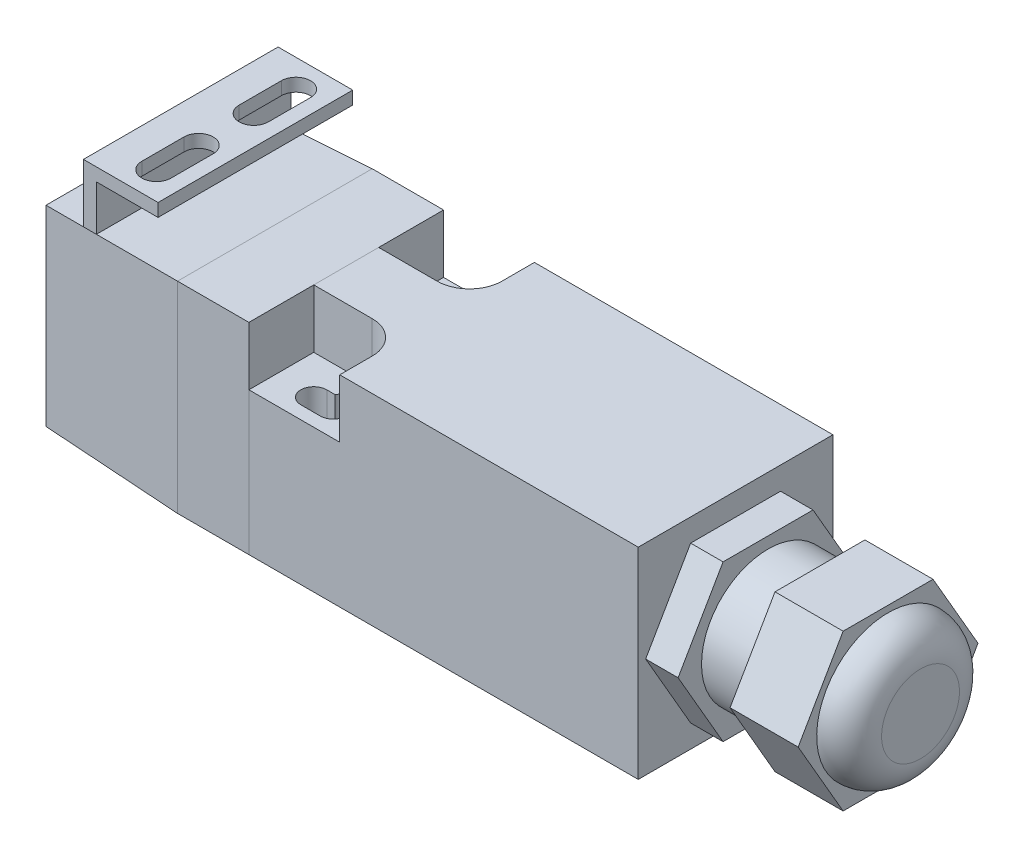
ISO-10303-21;
HEADER;
FILE_DESCRIPTION(('STEP AP214'),'2;1');
FILE_NAME('part.step','',(''),(''),'','','');
FILE_SCHEMA(('AUTOMOTIVE_DESIGN { 1 0 10303 214 1 1 1 1 }'));
ENDSEC;
DATA;
#1=APPLICATION_CONTEXT('core data for automotive mechanical design processes');
#2=APPLICATION_PROTOCOL_DEFINITION('international standard','automotive_design',2000,#1);
#3=PRODUCT_CONTEXT('',#1,'mechanical');
#4=PRODUCT('Part','Part','',(#3));
#5=PRODUCT_RELATED_PRODUCT_CATEGORY('part','',(#4));
#6=PRODUCT_DEFINITION_FORMATION('','',#4);
#7=PRODUCT_DEFINITION_CONTEXT('part definition',#1,'design');
#8=PRODUCT_DEFINITION('design','',#6,#7);
#9=PRODUCT_DEFINITION_SHAPE('','',#8);
#10=(LENGTH_UNIT() NAMED_UNIT(*) SI_UNIT(.MILLI.,.METRE.));
#11=(NAMED_UNIT(*) PLANE_ANGLE_UNIT() SI_UNIT($,.RADIAN.));
#12=(NAMED_UNIT(*) SI_UNIT($,.STERADIAN.) SOLID_ANGLE_UNIT());
#13=UNCERTAINTY_MEASURE_WITH_UNIT(LENGTH_MEASURE(1.E-05),#10,'distance_accuracy_value','');
#14=(GEOMETRIC_REPRESENTATION_CONTEXT(3) GLOBAL_UNCERTAINTY_ASSIGNED_CONTEXT((#13)) GLOBAL_UNIT_ASSIGNED_CONTEXT((#10,
#11,#12)) REPRESENTATION_CONTEXT('',''));
#15=CARTESIAN_POINT('',(0.,0.,0.));
#16=DIRECTION('',(0.,0.,1.));
#17=DIRECTION('',(1.,0.,0.));
#18=AXIS2_PLACEMENT_3D('',#15,#16,#17);
#19=CARTESIAN_POINT('',(-22.,10.5,7.5));
#20=DIRECTION('',(0.,-1.,0.));
#21=DIRECTION('',(0.,0.,-1.));
#22=AXIS2_PLACEMENT_3D('',#19,#20,#21);
#23=PLANE('',#22);
#24=DIRECTION('',(0.,0.,1.));
#25=VECTOR('',#24,1.);
#26=CARTESIAN_POINT('',(-25.5,10.5,-6.5));
#27=LINE('',#26,#25);
#28=CARTESIAN_POINT('',(-25.5,10.5,-6.5));
#29=VERTEX_POINT('',#28);
#30=CARTESIAN_POINT('',(-25.5,10.5,6.5));
#31=VERTEX_POINT('',#30);
#32=EDGE_CURVE('E51',#29,#31,#27,.T.);
#33=ORIENTED_EDGE('',*,*,#32,.F.);
#34=DIRECTION('',(-1.,0.,0.));
#35=VECTOR('',#34,1.);
#36=CARTESIAN_POINT('',(-25.5,10.5,-6.5));
#37=LINE('',#36,#35);
#38=CARTESIAN_POINT('',(-23.5,10.5,-6.5));
#39=VERTEX_POINT('',#38);
#40=EDGE_CURVE('E308',#39,#29,#37,.T.);
#41=ORIENTED_EDGE('',*,*,#40,.F.);
#42=DIRECTION('',(0.,0.,-1.));
#43=VECTOR('',#42,1.);
#44=CARTESIAN_POINT('',(-23.5,10.5,-6.5));
#45=LINE('',#44,#43);
#46=CARTESIAN_POINT('',(-23.5,10.5,6.5));
#47=VERTEX_POINT('',#46);
#48=EDGE_CURVE('E304',#47,#39,#45,.T.);
#49=ORIENTED_EDGE('',*,*,#48,.F.);
#50=DIRECTION('',(1.,0.,0.));
#51=VECTOR('',#50,1.);
#52=CARTESIAN_POINT('',(-25.5,10.5,6.5));
#53=LINE('',#52,#51);
#54=EDGE_CURVE('E302',#31,#47,#53,.T.);
#55=ORIENTED_EDGE('',*,*,#54,.F.);
#56=EDGE_LOOP('',(#33,#41,#49,#55));
#57=FACE_BOUND('',#56,.T.);
#58=ADVANCED_FACE('F43',(#57),#23,.T.);
#59=CARTESIAN_POINT('',(-25.5,-2.65294643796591,6.5));
#60=DIRECTION('',(0.,0.,1.));
#61=DIRECTION('',(1.,0.,0.));
#62=AXIS2_PLACEMENT_3D('',#59,#60,#61);
#63=PLANE('',#62);
#64=DIRECTION('',(0.,1.,0.));
#65=VECTOR('',#64,1.);
#66=CARTESIAN_POINT('',(-25.5,-2.65294643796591,6.5));
#67=LINE('',#66,#65);
#68=CARTESIAN_POINT('',(-25.5,15.5,6.5));
#69=VERTEX_POINT('',#68);
#70=EDGE_CURVE('E12',#31,#69,#67,.T.);
#71=ORIENTED_EDGE('',*,*,#70,.F.);
#72=ORIENTED_EDGE('',*,*,#54,.T.);
#73=DIRECTION('',(0.,1.,0.));
#74=VECTOR('',#73,1.);
#75=CARTESIAN_POINT('',(-23.5,-2.65294643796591,6.5));
#76=LINE('',#75,#74);
#77=CARTESIAN_POINT('',(-23.5,15.5,6.5));
#78=VERTEX_POINT('',#77);
#79=EDGE_CURVE('E315',#47,#78,#76,.T.);
#80=ORIENTED_EDGE('',*,*,#79,.T.);
#81=DIRECTION('',(1.,0.,0.));
#82=VECTOR('',#81,1.);
#83=CARTESIAN_POINT('',(-25.5,15.5,6.5));
#84=LINE('',#83,#82);
#85=EDGE_CURVE('E303',#69,#78,#84,.T.);
#86=ORIENTED_EDGE('',*,*,#85,.F.);
#87=EDGE_LOOP('',(#71,#72,#80,#86));
#88=FACE_BOUND('',#87,.T.);
#89=ADVANCED_FACE('F362',(#88),#63,.T.);
#90=CARTESIAN_POINT('',(-23.5,-2.65294643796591,-6.5));
#91=DIRECTION('',(1.,0.,0.));
#92=DIRECTION('',(0.,0.,-1.));
#93=AXIS2_PLACEMENT_3D('',#90,#91,#92);
#94=PLANE('',#93);
#95=DIRECTION('',(0.,0.,-1.));
#96=VECTOR('',#95,1.);
#97=CARTESIAN_POINT('',(-23.5,22.5,15.));
#98=LINE('',#97,#96);
#99=CARTESIAN_POINT('',(-23.5,22.5,15.));
#100=VERTEX_POINT('',#99);
#101=CARTESIAN_POINT('',(-23.5,22.5,-15.));
#102=VERTEX_POINT('',#101);
#103=EDGE_CURVE('E235',#100,#102,#98,.T.);
#104=ORIENTED_EDGE('',*,*,#103,.F.);
#105=DIRECTION('',(0.,-1.,0.));
#106=VECTOR('',#105,1.);
#107=CARTESIAN_POINT('',(-23.5,24.5,15.));
#108=LINE('',#107,#106);
#109=CARTESIAN_POINT('',(-23.5,15.5,15.));
#110=VERTEX_POINT('',#109);
#111=EDGE_CURVE('E256',#100,#110,#108,.T.);
#112=ORIENTED_EDGE('',*,*,#111,.T.);
#113=DIRECTION('',(0.,0.,-1.));
#114=VECTOR('',#113,1.);
#115=CARTESIAN_POINT('',(-23.5,15.5,15.));
#116=LINE('',#115,#114);
#117=EDGE_CURVE('E268',#110,#78,#116,.T.);
#118=ORIENTED_EDGE('',*,*,#117,.T.);
#119=ORIENTED_EDGE('',*,*,#79,.F.);
#120=ORIENTED_EDGE('',*,*,#48,.T.);
#121=DIRECTION('',(0.,1.,0.));
#122=VECTOR('',#121,1.);
#123=CARTESIAN_POINT('',(-23.5,-2.65294643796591,-6.5));
#124=LINE('',#123,#122);
#125=CARTESIAN_POINT('',(-23.5,15.5,-6.5));
#126=VERTEX_POINT('',#125);
#127=EDGE_CURVE('E311',#39,#126,#124,.T.);
#128=ORIENTED_EDGE('',*,*,#127,.T.);
#129=CARTESIAN_POINT('',(-23.5,15.5,-15.));
#130=VERTEX_POINT('',#129);
#131=EDGE_CURVE('E264',#126,#130,#116,.T.);
#132=ORIENTED_EDGE('',*,*,#131,.T.);
#133=DIRECTION('',(0.,-1.,0.));
#134=VECTOR('',#133,1.);
#135=CARTESIAN_POINT('',(-23.5,24.5,-15.));
#136=LINE('',#135,#134);
#137=EDGE_CURVE('E320',#102,#130,#136,.T.);
#138=ORIENTED_EDGE('',*,*,#137,.F.);
#139=EDGE_LOOP('',(#104,#112,#118,#119,#120,#128,#132,#138));
#140=FACE_BOUND('',#139,.T.);
#141=ADVANCED_FACE('F368',(#140),#94,.T.);
#142=CARTESIAN_POINT('',(-25.5,-2.65294643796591,-6.5));
#143=DIRECTION('',(0.,0.,-1.));
#144=DIRECTION('',(-1.,0.,0.));
#145=AXIS2_PLACEMENT_3D('',#142,#143,#144);
#146=PLANE('',#145);
#147=ORIENTED_EDGE('',*,*,#127,.F.);
#148=ORIENTED_EDGE('',*,*,#40,.T.);
#149=DIRECTION('',(0.,1.,0.));
#150=VECTOR('',#149,1.);
#151=CARTESIAN_POINT('',(-25.5,-2.65294643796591,-6.5));
#152=LINE('',#151,#150);
#153=CARTESIAN_POINT('',(-25.5,15.5,-6.5));
#154=VERTEX_POINT('',#153);
#155=EDGE_CURVE('E306',#29,#154,#152,.T.);
#156=ORIENTED_EDGE('',*,*,#155,.T.);
#157=DIRECTION('',(-1.,0.,0.));
#158=VECTOR('',#157,1.);
#159=CARTESIAN_POINT('',(-25.5,15.5,-6.5));
#160=LINE('',#159,#158);
#161=EDGE_CURVE('E298',#126,#154,#160,.T.);
#162=ORIENTED_EDGE('',*,*,#161,.F.);
#163=EDGE_LOOP('',(#147,#148,#156,#162));
#164=FACE_BOUND('',#163,.T.);
#165=ADVANCED_FACE('F355',(#164),#146,.T.);
#166=CARTESIAN_POINT('',(-25.5,-2.65294643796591,-6.5));
#167=DIRECTION('',(-1.,0.,0.));
#168=DIRECTION('',(0.,0.,1.));
#169=AXIS2_PLACEMENT_3D('',#166,#167,#168);
#170=PLANE('',#169);
#171=ORIENTED_EDGE('',*,*,#155,.F.);
#172=ORIENTED_EDGE('',*,*,#32,.T.);
#173=ORIENTED_EDGE('',*,*,#70,.T.);
#174=DIRECTION('',(0.,0.,1.));
#175=VECTOR('',#174,1.);
#176=CARTESIAN_POINT('',(-25.5,15.5,15.));
#177=LINE('',#176,#175);
#178=CARTESIAN_POINT('',(-25.5,15.5,15.));
#179=VERTEX_POINT('',#178);
#180=EDGE_CURVE('E287',#69,#179,#177,.T.);
#181=ORIENTED_EDGE('',*,*,#180,.T.);
#182=DIRECTION('',(0.,-1.,0.));
#183=VECTOR('',#182,1.);
#184=CARTESIAN_POINT('',(-25.5,24.5,15.));
#185=LINE('',#184,#183);
#186=CARTESIAN_POINT('',(-25.5,24.5,15.));
#187=VERTEX_POINT('',#186);
#188=EDGE_CURVE('E328',#187,#179,#185,.T.);
#189=ORIENTED_EDGE('',*,*,#188,.F.);
#190=DIRECTION('',(0.,0.,1.));
#191=VECTOR('',#190,1.);
#192=CARTESIAN_POINT('',(-25.5,24.5,15.));
#193=LINE('',#192,#191);
#194=CARTESIAN_POINT('',(-25.5,24.5,-15.));
#195=VERTEX_POINT('',#194);
#196=EDGE_CURVE('E337',#195,#187,#193,.T.);
#197=ORIENTED_EDGE('',*,*,#196,.F.);
#198=DIRECTION('',(0.,-1.,0.));
#199=VECTOR('',#198,1.);
#200=CARTESIAN_POINT('',(-25.5,24.5,-15.));
#201=LINE('',#200,#199);
#202=CARTESIAN_POINT('',(-25.5,15.5,-15.));
#203=VERTEX_POINT('',#202);
#204=EDGE_CURVE('E323',#195,#203,#201,.T.);
#205=ORIENTED_EDGE('',*,*,#204,.T.);
#206=EDGE_CURVE('E279',#203,#154,#177,.T.);
#207=ORIENTED_EDGE('',*,*,#206,.T.);
#208=EDGE_LOOP('',(#171,#172,#173,#181,#189,#197,#205,#207));
#209=FACE_BOUND('',#208,.T.);
#210=ADVANCED_FACE('F347',(#209),#170,.T.);
#211=CARTESIAN_POINT('',(-23.5,15.5,-15.));
#212=DIRECTION('',(0.,1.,0.));
#213=DIRECTION('',(0.,0.,1.));
#214=AXIS2_PLACEMENT_3D('',#211,#212,#213);
#215=PLANE('',#214);
#216=ORIENTED_EDGE('',*,*,#180,.F.);
#217=ORIENTED_EDGE('',*,*,#85,.T.);
#218=ORIENTED_EDGE('',*,*,#117,.F.);
#219=DIRECTION('',(1.,0.,0.));
#220=VECTOR('',#219,1.);
#221=CARTESIAN_POINT('',(-23.5,15.5,15.));
#222=LINE('',#221,#220);
#223=EDGE_CURVE('E290',#179,#110,#222,.T.);
#224=ORIENTED_EDGE('',*,*,#223,.F.);
#225=EDGE_LOOP('',(#216,#217,#218,#224));
#226=FACE_BOUND('',#225,.T.);
#227=ADVANCED_FACE('F367',(#226),#215,.F.);
#228=ORIENTED_EDGE('',*,*,#131,.F.);
#229=ORIENTED_EDGE('',*,*,#161,.T.);
#230=ORIENTED_EDGE('',*,*,#206,.F.);
#231=DIRECTION('',(-1.,0.,0.));
#232=VECTOR('',#231,1.);
#233=CARTESIAN_POINT('',(-23.5,15.5,-15.));
#234=LINE('',#233,#232);
#235=EDGE_CURVE('E274',#130,#203,#234,.T.);
#236=ORIENTED_EDGE('',*,*,#235,.F.);
#237=EDGE_LOOP('',(#228,#229,#230,#236));
#238=FACE_BOUND('',#237,.T.);
#239=ADVANCED_FACE('F351',(#238),#215,.F.);
#240=CARTESIAN_POINT('',(-23.5,24.5,-15.));
#241=DIRECTION('',(0.,0.,1.));
#242=DIRECTION('',(1.,0.,0.));
#243=AXIS2_PLACEMENT_3D('',#240,#241,#242);
#244=PLANE('',#243);
#245=ORIENTED_EDGE('',*,*,#235,.T.);
#246=ORIENTED_EDGE('',*,*,#204,.F.);
#247=DIRECTION('',(-1.,0.,0.));
#248=VECTOR('',#247,1.);
#249=CARTESIAN_POINT('',(-23.5,24.5,-15.));
#250=LINE('',#249,#248);
#251=CARTESIAN_POINT('',(-14.,24.5,-15.));
#252=VERTEX_POINT('',#251);
#253=EDGE_CURVE('E250',#252,#195,#250,.T.);
#254=ORIENTED_EDGE('',*,*,#253,.F.);
#255=DIRECTION('',(0.,1.,0.));
#256=VECTOR('',#255,1.);
#257=CARTESIAN_POINT('',(-14.,24.5,-15.));
#258=LINE('',#257,#256);
#259=CARTESIAN_POINT('',(-14.,22.5,-15.));
#260=VERTEX_POINT('',#259);
#261=EDGE_CURVE('E241',#260,#252,#258,.T.);
#262=ORIENTED_EDGE('',*,*,#261,.F.);
#263=DIRECTION('',(-1.,0.,0.));
#264=VECTOR('',#263,1.);
#265=CARTESIAN_POINT('',(-14.,22.5,-15.));
#266=LINE('',#265,#264);
#267=EDGE_CURVE('E247',#260,#102,#266,.T.);
#268=ORIENTED_EDGE('',*,*,#267,.T.);
#269=ORIENTED_EDGE('',*,*,#137,.T.);
#270=EDGE_LOOP('',(#245,#246,#254,#262,#268,#269));
#271=FACE_BOUND('',#270,.T.);
#272=ADVANCED_FACE('F416',(#271),#244,.F.);
#273=CARTESIAN_POINT('',(-23.5,24.5,15.));
#274=DIRECTION('',(0.,0.,-1.));
#275=DIRECTION('',(-1.,0.,0.));
#276=AXIS2_PLACEMENT_3D('',#273,#274,#275);
#277=PLANE('',#276);
#278=ORIENTED_EDGE('',*,*,#223,.T.);
#279=ORIENTED_EDGE('',*,*,#111,.F.);
#280=DIRECTION('',(-1.,0.,0.));
#281=VECTOR('',#280,1.);
#282=CARTESIAN_POINT('',(-14.,22.5,15.));
#283=LINE('',#282,#281);
#284=CARTESIAN_POINT('',(-14.,22.5,15.));
#285=VERTEX_POINT('',#284);
#286=EDGE_CURVE('E261',#285,#100,#283,.T.);
#287=ORIENTED_EDGE('',*,*,#286,.F.);
#288=DIRECTION('',(0.,-1.,0.));
#289=VECTOR('',#288,1.);
#290=CARTESIAN_POINT('',(-14.,24.5,15.));
#291=LINE('',#290,#289);
#292=CARTESIAN_POINT('',(-14.,24.5,15.));
#293=VERTEX_POINT('',#292);
#294=EDGE_CURVE('E236',#293,#285,#291,.T.);
#295=ORIENTED_EDGE('',*,*,#294,.F.);
#296=DIRECTION('',(1.,0.,0.));
#297=VECTOR('',#296,1.);
#298=CARTESIAN_POINT('',(-23.5,24.5,15.));
#299=LINE('',#298,#297);
#300=EDGE_CURVE('E285',#187,#293,#299,.T.);
#301=ORIENTED_EDGE('',*,*,#300,.F.);
#302=ORIENTED_EDGE('',*,*,#188,.T.);
#303=EDGE_LOOP('',(#278,#279,#287,#295,#301,#302));
#304=FACE_BOUND('',#303,.T.);
#305=ADVANCED_FACE('F429',(#304),#277,.F.);
#306=CARTESIAN_POINT('',(-23.5,24.5,-15.));
#307=DIRECTION('',(0.,1.,0.));
#308=DIRECTION('',(0.,0.,1.));
#309=AXIS2_PLACEMENT_3D('',#306,#307,#308);
#310=PLANE('',#309);
#311=CARTESIAN_POINT('',(-18.5,24.4999999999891,10.75));
#312=DIRECTION('',(0.,1.,0.));
#313=DIRECTION('',(0.,0.,1.));
#314=AXIS2_PLACEMENT_3D('',#311,#312,#313);
#315=CIRCLE('',#314,2.25);
#316=CARTESIAN_POINT('',(-20.75,24.4999999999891,10.75));
#317=VERTEX_POINT('',#316);
#318=CARTESIAN_POINT('',(-16.25,24.5,10.75));
#319=VERTEX_POINT('',#318);
#320=EDGE_CURVE('E59',#317,#319,#315,.T.);
#321=ORIENTED_EDGE('',*,*,#320,.F.);
#322=DIRECTION('',(0.,0.,1.));
#323=VECTOR('',#322,1.);
#324=CARTESIAN_POINT('',(-20.75,24.4999999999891,10.75));
#325=LINE('',#324,#323);
#326=CARTESIAN_POINT('',(-20.75,24.4999999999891,4.24999999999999));
#327=VERTEX_POINT('',#326);
#328=EDGE_CURVE('E176',#327,#317,#325,.T.);
#329=ORIENTED_EDGE('',*,*,#328,.F.);
#330=CARTESIAN_POINT('',(-18.5,24.4999999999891,4.24999999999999));
#331=DIRECTION('',(0.,1.,0.));
#332=DIRECTION('',(0.,0.,1.));
#333=AXIS2_PLACEMENT_3D('',#330,#331,#332);
#334=CIRCLE('',#333,2.25);
#335=CARTESIAN_POINT('',(-16.25,24.4999999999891,4.24999999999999));
#336=VERTEX_POINT('',#335);
#337=EDGE_CURVE('E196',#336,#327,#334,.T.);
#338=ORIENTED_EDGE('',*,*,#337,.F.);
#339=DIRECTION('',(0.,0.,-1.));
#340=VECTOR('',#339,1.);
#341=CARTESIAN_POINT('',(-16.25,24.4999999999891,10.75));
#342=LINE('',#341,#340);
#343=EDGE_CURVE('E190',#319,#336,#342,.T.);
#344=ORIENTED_EDGE('',*,*,#343,.F.);
#345=EDGE_LOOP('',(#321,#329,#338,#344));
#346=FACE_BOUND('',#345,.T.);
#347=CARTESIAN_POINT('',(-18.5,24.4999999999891,-4.25));
#348=DIRECTION('',(0.,1.,0.));
#349=DIRECTION('',(0.,0.,1.));
#350=AXIS2_PLACEMENT_3D('',#347,#348,#349);
#351=CIRCLE('',#350,2.25);
#352=CARTESIAN_POINT('',(-20.75,24.4999999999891,-4.25));
#353=VERTEX_POINT('',#352);
#354=CARTESIAN_POINT('',(-16.25,24.5,-4.25));
#355=VERTEX_POINT('',#354);
#356=EDGE_CURVE('E212',#353,#355,#351,.T.);
#357=ORIENTED_EDGE('',*,*,#356,.F.);
#358=DIRECTION('',(0.,0.,1.));
#359=VECTOR('',#358,1.);
#360=CARTESIAN_POINT('',(-20.75,24.4999999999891,-4.25));
#361=LINE('',#360,#359);
#362=CARTESIAN_POINT('',(-20.75,24.4999999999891,-10.75));
#363=VERTEX_POINT('',#362);
#364=EDGE_CURVE('E220',#363,#353,#361,.T.);
#365=ORIENTED_EDGE('',*,*,#364,.F.);
#366=CARTESIAN_POINT('',(-18.5,24.4999999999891,-10.75));
#367=DIRECTION('',(0.,1.,0.));
#368=DIRECTION('',(0.,0.,1.));
#369=AXIS2_PLACEMENT_3D('',#366,#367,#368);
#370=CIRCLE('',#369,2.25);
#371=CARTESIAN_POINT('',(-16.25,24.4999999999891,-10.75));
#372=VERTEX_POINT('',#371);
#373=EDGE_CURVE('E217',#372,#363,#370,.T.);
#374=ORIENTED_EDGE('',*,*,#373,.F.);
#375=DIRECTION('',(0.,0.,-1.));
#376=VECTOR('',#375,1.);
#377=CARTESIAN_POINT('',(-16.25,24.4999999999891,-4.25));
#378=LINE('',#377,#376);
#379=EDGE_CURVE('E214',#355,#372,#378,.T.);
#380=ORIENTED_EDGE('',*,*,#379,.F.);
#381=EDGE_LOOP('',(#357,#365,#374,#380));
#382=FACE_BOUND('',#381,.T.);
#383=ORIENTED_EDGE('',*,*,#300,.T.);
#384=DIRECTION('',(0.,0.,1.));
#385=VECTOR('',#384,1.);
#386=CARTESIAN_POINT('',(-14.,24.5,15.));
#387=LINE('',#386,#385);
#388=EDGE_CURVE('E244',#252,#293,#387,.T.);
#389=ORIENTED_EDGE('',*,*,#388,.F.);
#390=ORIENTED_EDGE('',*,*,#253,.T.);
#391=ORIENTED_EDGE('',*,*,#196,.T.);
#392=EDGE_LOOP('',(#383,#389,#390,#391));
#393=FACE_BOUND('',#392,.T.);
#394=ADVANCED_FACE('F440',(#346,#382,#393),#310,.T.);
#395=CARTESIAN_POINT('',(-14.,22.5,15.));
#396=DIRECTION('',(0.,1.,0.));
#397=DIRECTION('',(0.,0.,1.));
#398=AXIS2_PLACEMENT_3D('',#395,#396,#397);
#399=PLANE('',#398);
#400=DIRECTION('',(0.,0.,-1.));
#401=VECTOR('',#400,1.);
#402=CARTESIAN_POINT('',(-20.75,22.5,10.75));
#403=LINE('',#402,#401);
#404=CARTESIAN_POINT('',(-20.75,22.5,10.75));
#405=VERTEX_POINT('',#404);
#406=CARTESIAN_POINT('',(-20.75,22.5,4.24999999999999));
#407=VERTEX_POINT('',#406);
#408=EDGE_CURVE('E188',#405,#407,#403,.T.);
#409=ORIENTED_EDGE('',*,*,#408,.F.);
#410=CARTESIAN_POINT('',(-18.5,22.5,10.75));
#411=DIRECTION('',(0.,1.,0.));
#412=DIRECTION('',(0.,0.,1.));
#413=AXIS2_PLACEMENT_3D('',#410,#411,#412);
#414=CIRCLE('',#413,2.25);
#415=CARTESIAN_POINT('',(-16.25,22.5,10.75));
#416=VERTEX_POINT('',#415);
#417=EDGE_CURVE('E170',#416,#405,#414,.F.);
#418=ORIENTED_EDGE('',*,*,#417,.F.);
#419=DIRECTION('',(0.,0.,1.));
#420=VECTOR('',#419,1.);
#421=CARTESIAN_POINT('',(-16.25,22.5,10.75));
#422=LINE('',#421,#420);
#423=CARTESIAN_POINT('',(-16.25,22.5,4.24999999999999));
#424=VERTEX_POINT('',#423);
#425=EDGE_CURVE('E179',#424,#416,#422,.T.);
#426=ORIENTED_EDGE('',*,*,#425,.F.);
#427=CARTESIAN_POINT('',(-18.5,22.5,4.24999999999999));
#428=DIRECTION('',(0.,1.,0.));
#429=DIRECTION('',(0.,0.,1.));
#430=AXIS2_PLACEMENT_3D('',#427,#428,#429);
#431=CIRCLE('',#430,2.25);
#432=EDGE_CURVE('E67',#407,#424,#431,.F.);
#433=ORIENTED_EDGE('',*,*,#432,.F.);
#434=EDGE_LOOP('',(#409,#418,#426,#433));
#435=FACE_BOUND('',#434,.T.);
#436=DIRECTION('',(0.,0.,-1.));
#437=VECTOR('',#436,1.);
#438=CARTESIAN_POINT('',(-20.75,22.5,-4.25));
#439=LINE('',#438,#437);
#440=CARTESIAN_POINT('',(-20.75,22.5,-4.25));
#441=VERTEX_POINT('',#440);
#442=CARTESIAN_POINT('',(-20.75,22.5,-10.75));
#443=VERTEX_POINT('',#442);
#444=EDGE_CURVE('E206',#441,#443,#439,.T.);
#445=ORIENTED_EDGE('',*,*,#444,.F.);
#446=CARTESIAN_POINT('',(-18.5,22.5,-4.25));
#447=DIRECTION('',(0.,1.,0.));
#448=DIRECTION('',(0.,0.,1.));
#449=AXIS2_PLACEMENT_3D('',#446,#447,#448);
#450=CIRCLE('',#449,2.25);
#451=CARTESIAN_POINT('',(-16.25,22.5,-4.25));
#452=VERTEX_POINT('',#451);
#453=EDGE_CURVE('E209',#452,#441,#450,.F.);
#454=ORIENTED_EDGE('',*,*,#453,.F.);
#455=DIRECTION('',(0.,0.,1.));
#456=VECTOR('',#455,1.);
#457=CARTESIAN_POINT('',(-16.25,22.5,-4.25));
#458=LINE('',#457,#456);
#459=CARTESIAN_POINT('',(-16.25,22.5,-10.75));
#460=VERTEX_POINT('',#459);
#461=EDGE_CURVE('E226',#460,#452,#458,.T.);
#462=ORIENTED_EDGE('',*,*,#461,.F.);
#463=CARTESIAN_POINT('',(-18.5,22.5,-10.75));
#464=DIRECTION('',(0.,1.,0.));
#465=DIRECTION('',(0.,0.,1.));
#466=AXIS2_PLACEMENT_3D('',#463,#464,#465);
#467=CIRCLE('',#466,2.25);
#468=EDGE_CURVE('E182',#443,#460,#467,.F.);
#469=ORIENTED_EDGE('',*,*,#468,.F.);
#470=EDGE_LOOP('',(#445,#454,#462,#469));
#471=FACE_BOUND('',#470,.T.);
#472=ORIENTED_EDGE('',*,*,#103,.T.);
#473=ORIENTED_EDGE('',*,*,#267,.F.);
#474=DIRECTION('',(0.,0.,-1.));
#475=VECTOR('',#474,1.);
#476=CARTESIAN_POINT('',(-14.,22.5,15.));
#477=LINE('',#476,#475);
#478=EDGE_CURVE('E239',#285,#260,#477,.T.);
#479=ORIENTED_EDGE('',*,*,#478,.F.);
#480=ORIENTED_EDGE('',*,*,#286,.T.);
#481=EDGE_LOOP('',(#472,#473,#479,#480));
#482=FACE_BOUND('',#481,.T.);
#483=ADVANCED_FACE('F185',(#435,#471,#482),#399,.F.);
#484=CARTESIAN_POINT('',(-14.,22.5,15.));
#485=DIRECTION('',(1.,0.,0.));
#486=DIRECTION('',(0.,0.,-1.));
#487=AXIS2_PLACEMENT_3D('',#484,#485,#486);
#488=PLANE('',#487);
#489=ORIENTED_EDGE('',*,*,#294,.T.);
#490=ORIENTED_EDGE('',*,*,#478,.T.);
#491=ORIENTED_EDGE('',*,*,#261,.T.);
#492=ORIENTED_EDGE('',*,*,#388,.T.);
#493=EDGE_LOOP('',(#489,#490,#491,#492));
#494=FACE_BOUND('',#493,.T.);
#495=ADVANCED_FACE('F448',(#494),#488,.T.);
#496=CARTESIAN_POINT('',(-18.5,-15.501,-4.25));
#497=DIRECTION('',(0.,1.,0.));
#498=DIRECTION('',(0.,0.,1.));
#499=AXIS2_PLACEMENT_3D('',#496,#497,#498);
#500=CYLINDRICAL_SURFACE('',#499,2.25);
#501=ORIENTED_EDGE('',*,*,#453,.T.);
#502=DIRECTION('',(0.,1.,0.));
#503=VECTOR('',#502,1.);
#504=CARTESIAN_POINT('',(-20.75,-15.501,-4.25));
#505=LINE('',#504,#503);
#506=EDGE_CURVE('E224',#441,#353,#505,.T.);
#507=ORIENTED_EDGE('',*,*,#506,.T.);
#508=ORIENTED_EDGE('',*,*,#356,.T.);
#509=DIRECTION('',(0.,1.,0.));
#510=VECTOR('',#509,1.);
#511=CARTESIAN_POINT('',(-16.25,-15.501,-4.25));
#512=LINE('',#511,#510);
#513=EDGE_CURVE('E223',#452,#355,#512,.T.);
#514=ORIENTED_EDGE('',*,*,#513,.F.);
#515=EDGE_LOOP('',(#501,#507,#508,#514));
#516=FACE_BOUND('',#515,.T.);
#517=ADVANCED_FACE('F453',(#516),#500,.F.);
#518=CARTESIAN_POINT('',(-20.75,-15.501,-4.25));
#519=DIRECTION('',(-1.,0.,0.));
#520=DIRECTION('',(0.,0.,1.));
#521=AXIS2_PLACEMENT_3D('',#518,#519,#520);
#522=PLANE('',#521);
#523=ORIENTED_EDGE('',*,*,#444,.T.);
#524=DIRECTION('',(0.,1.,0.));
#525=VECTOR('',#524,1.);
#526=CARTESIAN_POINT('',(-20.75,-15.501,-10.75));
#527=LINE('',#526,#525);
#528=EDGE_CURVE('E227',#443,#363,#527,.T.);
#529=ORIENTED_EDGE('',*,*,#528,.T.);
#530=ORIENTED_EDGE('',*,*,#364,.T.);
#531=ORIENTED_EDGE('',*,*,#506,.F.);
#532=EDGE_LOOP('',(#523,#529,#530,#531));
#533=FACE_BOUND('',#532,.T.);
#534=ADVANCED_FACE('F465',(#533),#522,.F.);
#535=CARTESIAN_POINT('',(-18.5,-15.501,-10.75));
#536=DIRECTION('',(0.,1.,0.));
#537=DIRECTION('',(0.,0.,1.));
#538=AXIS2_PLACEMENT_3D('',#535,#536,#537);
#539=CYLINDRICAL_SURFACE('',#538,2.25);
#540=ORIENTED_EDGE('',*,*,#468,.T.);
#541=DIRECTION('',(0.,1.,0.));
#542=VECTOR('',#541,1.);
#543=CARTESIAN_POINT('',(-16.25,-15.501,-10.75));
#544=LINE('',#543,#542);
#545=EDGE_CURVE('E229',#460,#372,#544,.T.);
#546=ORIENTED_EDGE('',*,*,#545,.T.);
#547=ORIENTED_EDGE('',*,*,#373,.T.);
#548=ORIENTED_EDGE('',*,*,#528,.F.);
#549=EDGE_LOOP('',(#540,#546,#547,#548));
#550=FACE_BOUND('',#549,.T.);
#551=ADVANCED_FACE('F475',(#550),#539,.F.);
#552=CARTESIAN_POINT('',(-16.25,-15.501,-4.25));
#553=DIRECTION('',(1.,0.,0.));
#554=DIRECTION('',(0.,0.,-1.));
#555=AXIS2_PLACEMENT_3D('',#552,#553,#554);
#556=PLANE('',#555);
#557=ORIENTED_EDGE('',*,*,#461,.T.);
#558=ORIENTED_EDGE('',*,*,#513,.T.);
#559=ORIENTED_EDGE('',*,*,#379,.T.);
#560=ORIENTED_EDGE('',*,*,#545,.F.);
#561=EDGE_LOOP('',(#557,#558,#559,#560));
#562=FACE_BOUND('',#561,.T.);
#563=ADVANCED_FACE('F485',(#562),#556,.F.);
#564=CARTESIAN_POINT('',(-18.5,10.498975,10.75));
#565=DIRECTION('',(0.,1.,0.));
#566=DIRECTION('',(0.,0.,1.));
#567=AXIS2_PLACEMENT_3D('',#564,#565,#566);
#568=CYLINDRICAL_SURFACE('',#567,2.25);
#569=ORIENTED_EDGE('',*,*,#417,.T.);
#570=DIRECTION('',(0.,1.,0.));
#571=VECTOR('',#570,1.);
#572=CARTESIAN_POINT('',(-20.75,10.498975,10.75));
#573=LINE('',#572,#571);
#574=EDGE_CURVE('E183',#405,#317,#573,.T.);
#575=ORIENTED_EDGE('',*,*,#574,.T.);
#576=ORIENTED_EDGE('',*,*,#320,.T.);
#577=DIRECTION('',(0.,1.,0.));
#578=VECTOR('',#577,1.);
#579=CARTESIAN_POINT('',(-16.25,10.498975,10.75));
#580=LINE('',#579,#578);
#581=EDGE_CURVE('E166',#416,#319,#580,.T.);
#582=ORIENTED_EDGE('',*,*,#581,.F.);
#583=EDGE_LOOP('',(#569,#575,#576,#582));
#584=FACE_BOUND('',#583,.T.);
#585=ADVANCED_FACE('F168',(#584),#568,.F.);
#586=CARTESIAN_POINT('',(-20.75,10.498975,10.75));
#587=DIRECTION('',(-1.,0.,0.));
#588=DIRECTION('',(0.,0.,1.));
#589=AXIS2_PLACEMENT_3D('',#586,#587,#588);
#590=PLANE('',#589);
#591=ORIENTED_EDGE('',*,*,#408,.T.);
#592=DIRECTION('',(0.,1.,0.));
#593=VECTOR('',#592,1.);
#594=CARTESIAN_POINT('',(-20.75,10.498975,4.24999999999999));
#595=LINE('',#594,#593);
#596=EDGE_CURVE('E202',#407,#327,#595,.T.);
#597=ORIENTED_EDGE('',*,*,#596,.T.);
#598=ORIENTED_EDGE('',*,*,#328,.T.);
#599=ORIENTED_EDGE('',*,*,#574,.F.);
#600=EDGE_LOOP('',(#591,#597,#598,#599));
#601=FACE_BOUND('',#600,.T.);
#602=ADVANCED_FACE('F517',(#601),#590,.F.);
#603=CARTESIAN_POINT('',(-18.5,10.498975,4.24999999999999));
#604=DIRECTION('',(0.,1.,0.));
#605=DIRECTION('',(0.,0.,1.));
#606=AXIS2_PLACEMENT_3D('',#603,#604,#605);
#607=CYLINDRICAL_SURFACE('',#606,2.25);
#608=ORIENTED_EDGE('',*,*,#432,.T.);
#609=DIRECTION('',(0.,1.,0.));
#610=VECTOR('',#609,1.);
#611=CARTESIAN_POINT('',(-16.25,10.498975,4.24999999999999));
#612=LINE('',#611,#610);
#613=EDGE_CURVE('E175',#424,#336,#612,.T.);
#614=ORIENTED_EDGE('',*,*,#613,.T.);
#615=ORIENTED_EDGE('',*,*,#337,.T.);
#616=ORIENTED_EDGE('',*,*,#596,.F.);
#617=EDGE_LOOP('',(#608,#614,#615,#616));
#618=FACE_BOUND('',#617,.T.);
#619=ADVANCED_FACE('F526',(#618),#607,.F.);
#620=CARTESIAN_POINT('',(-16.25,10.498975,10.75));
#621=DIRECTION('',(1.,0.,0.));
#622=DIRECTION('',(0.,0.,-1.));
#623=AXIS2_PLACEMENT_3D('',#620,#621,#622);
#624=PLANE('',#623);
#625=ORIENTED_EDGE('',*,*,#425,.T.);
#626=ORIENTED_EDGE('',*,*,#581,.T.);
#627=ORIENTED_EDGE('',*,*,#343,.T.);
#628=ORIENTED_EDGE('',*,*,#613,.F.);
#629=EDGE_LOOP('',(#625,#626,#627,#628));
#630=FACE_BOUND('',#629,.T.);
#631=ADVANCED_FACE('F180',(#630),#624,.F.);
#632=CLOSED_SHELL('',(#58,#89,#141,#165,#210,#227,#239,#272,#305,#394,#483,#495,#517,#534,#551,
#563,#585,#602,#619,#631));
#633=MANIFOLD_SOLID_BREP('B2',#632);
#634=CARTESIAN_POINT('',(-11.,-15.5,-15.));
#635=DIRECTION('',(0.,0.,1.));
#636=DIRECTION('',(1.,0.,0.));
#637=AXIS2_PLACEMENT_3D('',#634,#635,#636);
#638=PLANE('',#637);
#639=DIRECTION('',(0.,-1.,0.));
#640=VECTOR('',#639,1.);
#641=CARTESIAN_POINT('',(0.,-15.5,-15.));
#642=LINE('',#641,#640);
#643=CARTESIAN_POINT('',(0.,15.5,-15.));
#644=VERTEX_POINT('',#643);
#645=CARTESIAN_POINT('',(0.,-15.5,-15.));
#646=VERTEX_POINT('',#645);
#647=EDGE_CURVE('E705',#644,#646,#642,.T.);
#648=ORIENTED_EDGE('',*,*,#647,.T.);
#649=DIRECTION('',(1.,0.,0.));
#650=VECTOR('',#649,1.);
#651=CARTESIAN_POINT('',(-11.,-15.5,-15.));
#652=LINE('',#651,#650);
#653=CARTESIAN_POINT('',(-11.,-15.5,-15.));
#654=VERTEX_POINT('',#653);
#655=EDGE_CURVE('E746',#654,#646,#652,.T.);
#656=ORIENTED_EDGE('',*,*,#655,.F.);
#657=DIRECTION('',(0.,-1.,0.));
#658=VECTOR('',#657,1.);
#659=CARTESIAN_POINT('',(-11.,-15.5,-15.));
#660=LINE('',#659,#658);
#661=CARTESIAN_POINT('',(-11.,15.5,-15.));
#662=VERTEX_POINT('',#661);
#663=EDGE_CURVE('E723',#662,#654,#660,.T.);
#664=ORIENTED_EDGE('',*,*,#663,.F.);
#665=DIRECTION('',(1.,0.,0.));
#666=VECTOR('',#665,1.);
#667=CARTESIAN_POINT('',(-11.,15.5,-15.));
#668=LINE('',#667,#666);
#669=EDGE_CURVE('E733',#662,#644,#668,.T.);
#670=ORIENTED_EDGE('',*,*,#669,.T.);
#671=EDGE_LOOP('',(#648,#656,#664,#670));
#672=FACE_BOUND('',#671,.T.);
#673=ADVANCED_FACE('F585',(#672),#638,.F.);
#674=CARTESIAN_POINT('',(-11.,-15.5,-15.));
#675=DIRECTION('',(0.,1.,0.));
#676=DIRECTION('',(0.,0.,1.));
#677=AXIS2_PLACEMENT_3D('',#674,#675,#676);
#678=PLANE('',#677);
#679=DIRECTION('',(0.,0.,1.));
#680=VECTOR('',#679,1.);
#681=CARTESIAN_POINT('',(0.,-15.5,-15.));
#682=LINE('',#681,#680);
#683=CARTESIAN_POINT('',(0.,-15.5,15.));
#684=VERTEX_POINT('',#683);
#685=EDGE_CURVE('E736',#646,#684,#682,.T.);
#686=ORIENTED_EDGE('',*,*,#685,.T.);
#687=DIRECTION('',(1.,0.,0.));
#688=VECTOR('',#687,1.);
#689=CARTESIAN_POINT('',(-11.,-15.5,15.));
#690=LINE('',#689,#688);
#691=CARTESIAN_POINT('',(-11.,-15.5,15.));
#692=VERTEX_POINT('',#691);
#693=EDGE_CURVE('E743',#692,#684,#690,.T.);
#694=ORIENTED_EDGE('',*,*,#693,.F.);
#695=DIRECTION('',(0.,0.,1.));
#696=VECTOR('',#695,1.);
#697=CARTESIAN_POINT('',(-11.,-15.5,-15.));
#698=LINE('',#697,#696);
#699=EDGE_CURVE('E634',#654,#692,#698,.T.);
#700=ORIENTED_EDGE('',*,*,#699,.F.);
#701=ORIENTED_EDGE('',*,*,#655,.T.);
#702=EDGE_LOOP('',(#686,#694,#700,#701));
#703=FACE_BOUND('',#702,.T.);
#704=ADVANCED_FACE('F769',(#703),#678,.F.);
#705=CARTESIAN_POINT('',(-11.,-15.5,15.));
#706=DIRECTION('',(0.,0.,-1.));
#707=DIRECTION('',(-1.,0.,0.));
#708=AXIS2_PLACEMENT_3D('',#705,#706,#707);
#709=PLANE('',#708);
#710=DIRECTION('',(0.,1.,0.));
#711=VECTOR('',#710,1.);
#712=CARTESIAN_POINT('',(0.,-15.5,15.));
#713=LINE('',#712,#711);
#714=CARTESIAN_POINT('',(0.,15.5,15.));
#715=VERTEX_POINT('',#714);
#716=EDGE_CURVE('E738',#684,#715,#713,.T.);
#717=ORIENTED_EDGE('',*,*,#716,.T.);
#718=DIRECTION('',(1.,0.,0.));
#719=VECTOR('',#718,1.);
#720=CARTESIAN_POINT('',(-11.,15.5,15.));
#721=LINE('',#720,#719);
#722=CARTESIAN_POINT('',(-11.,15.5,15.));
#723=VERTEX_POINT('',#722);
#724=EDGE_CURVE('E608',#723,#715,#721,.T.);
#725=ORIENTED_EDGE('',*,*,#724,.F.);
#726=DIRECTION('',(0.,1.,0.));
#727=VECTOR('',#726,1.);
#728=CARTESIAN_POINT('',(-11.,-15.5,15.));
#729=LINE('',#728,#727);
#730=EDGE_CURVE('E727',#692,#723,#729,.T.);
#731=ORIENTED_EDGE('',*,*,#730,.F.);
#732=ORIENTED_EDGE('',*,*,#693,.T.);
#733=EDGE_LOOP('',(#717,#725,#731,#732));
#734=FACE_BOUND('',#733,.T.);
#735=ADVANCED_FACE('F774',(#734),#709,.F.);
#736=CARTESIAN_POINT('',(-11.,15.5,-15.));
#737=DIRECTION('',(0.,-1.,0.));
#738=DIRECTION('',(0.,0.,-1.));
#739=AXIS2_PLACEMENT_3D('',#736,#737,#738);
#740=PLANE('',#739);
#741=DIRECTION('',(0.,0.,-1.));
#742=VECTOR('',#741,1.);
#743=CARTESIAN_POINT('',(0.,15.5,-15.));
#744=LINE('',#743,#742);
#745=EDGE_CURVE('E628',#715,#644,#744,.T.);
#746=ORIENTED_EDGE('',*,*,#745,.T.);
#747=ORIENTED_EDGE('',*,*,#669,.F.);
#748=DIRECTION('',(0.,0.,-1.));
#749=VECTOR('',#748,1.);
#750=CARTESIAN_POINT('',(-11.,15.5,-15.));
#751=LINE('',#750,#749);
#752=EDGE_CURVE('E730',#723,#662,#751,.T.);
#753=ORIENTED_EDGE('',*,*,#752,.F.);
#754=ORIENTED_EDGE('',*,*,#724,.T.);
#755=EDGE_LOOP('',(#746,#747,#753,#754));
#756=FACE_BOUND('',#755,.T.);
#757=ADVANCED_FACE('F794',(#756),#740,.F.);
#758=CARTESIAN_POINT('',(0.,15.5,-15.));
#759=DIRECTION('',(1.,0.,0.));
#760=DIRECTION('',(0.,0.,-1.));
#761=AXIS2_PLACEMENT_3D('',#758,#759,#760);
#762=PLANE('',#761);
#763=ORIENTED_EDGE('',*,*,#647,.F.);
#764=ORIENTED_EDGE('',*,*,#745,.F.);
#765=ORIENTED_EDGE('',*,*,#716,.F.);
#766=ORIENTED_EDGE('',*,*,#685,.F.);
#767=EDGE_LOOP('',(#763,#764,#765,#766));
#768=FACE_BOUND('',#767,.T.);
#769=ADVANCED_FACE('F777',(#768),#762,.T.);
#770=CARTESIAN_POINT('',(-11.,15.5,-15.));
#771=DIRECTION('',(-0.034899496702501,0.,-0.999390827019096));
#772=DIRECTION('',(-0.999390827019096,0.,0.034899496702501));
#773=AXIS2_PLACEMENT_3D('',#770,#771,#772);
#774=PLANE('',#773);
#775=ORIENTED_EDGE('',*,*,#663,.T.);
#776=DIRECTION('',(0.998782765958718,-0.0348782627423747,-0.0348782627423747));
#777=VECTOR('',#776,1.);
#778=CARTESIAN_POINT('',(-11.,-15.5,-15.));
#779=LINE('',#778,#777);
#780=CARTESIAN_POINT('',(-32.,-14.7666638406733,-14.2666638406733));
#781=VERTEX_POINT('',#780);
#782=EDGE_CURVE('E702',#781,#654,#779,.T.);
#783=ORIENTED_EDGE('',*,*,#782,.F.);
#784=DIRECTION('',(0.,1.,0.));
#785=VECTOR('',#784,1.);
#786=CARTESIAN_POINT('',(-32.,15.5,-14.2666638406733));
#787=LINE('',#786,#785);
#788=CARTESIAN_POINT('',(-32.,14.7666638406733,-14.2666638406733));
#789=VERTEX_POINT('',#788);
#790=EDGE_CURVE('E697',#789,#781,#787,.F.);
#791=ORIENTED_EDGE('',*,*,#790,.F.);
#792=DIRECTION('',(0.998782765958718,0.0348782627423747,-0.0348782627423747));
#793=VECTOR('',#792,1.);
#794=CARTESIAN_POINT('',(-11.,15.5,-15.));
#795=LINE('',#794,#793);
#796=EDGE_CURVE('E707',#789,#662,#795,.T.);
#797=ORIENTED_EDGE('',*,*,#796,.T.);
#798=EDGE_LOOP('',(#775,#783,#791,#797));
#799=FACE_BOUND('',#798,.T.);
#800=ADVANCED_FACE('F793',(#799),#774,.T.);
#801=CARTESIAN_POINT('',(-11.,-15.5,-15.));
#802=DIRECTION('',(-0.034899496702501,-0.999390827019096,0.));
#803=DIRECTION('',(0.999390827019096,-0.034899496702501,0.));
#804=AXIS2_PLACEMENT_3D('',#801,#802,#803);
#805=PLANE('',#804);
#806=ORIENTED_EDGE('',*,*,#699,.T.);
#807=DIRECTION('',(0.998782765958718,-0.0348782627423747,0.0348782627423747));
#808=VECTOR('',#807,1.);
#809=CARTESIAN_POINT('',(-12.0799100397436,-15.4622887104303,14.9622887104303));
#810=LINE('',#809,#808);
#811=CARTESIAN_POINT('',(-32.,-14.7666638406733,14.2666638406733));
#812=VERTEX_POINT('',#811);
#813=EDGE_CURVE('E706',#812,#692,#810,.T.);
#814=ORIENTED_EDGE('',*,*,#813,.F.);
#815=DIRECTION('',(0.,0.,-1.));
#816=VECTOR('',#815,1.);
#817=CARTESIAN_POINT('',(-32.,-14.7666638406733,-15.));
#818=LINE('',#817,#816);
#819=EDGE_CURVE('E718',#781,#812,#818,.F.);
#820=ORIENTED_EDGE('',*,*,#819,.F.);
#821=ORIENTED_EDGE('',*,*,#782,.T.);
#822=EDGE_LOOP('',(#806,#814,#820,#821));
#823=FACE_BOUND('',#822,.T.);
#824=ADVANCED_FACE('F783',(#823),#805,.T.);
#825=CARTESIAN_POINT('',(-11.,15.5,15.));
#826=DIRECTION('',(-0.034899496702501,0.,0.999390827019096));
#827=DIRECTION('',(0.999390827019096,0.,0.034899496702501));
#828=AXIS2_PLACEMENT_3D('',#825,#826,#827);
#829=PLANE('',#828);
#830=ORIENTED_EDGE('',*,*,#730,.T.);
#831=DIRECTION('',(0.998782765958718,0.0348782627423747,0.0348782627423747));
#832=VECTOR('',#831,1.);
#833=CARTESIAN_POINT('',(-12.0450742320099,15.4635052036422,14.9635052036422));
#834=LINE('',#833,#832);
#835=CARTESIAN_POINT('',(-32.,14.7666638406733,14.2666638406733));
#836=VERTEX_POINT('',#835);
#837=EDGE_CURVE('E710',#836,#723,#834,.T.);
#838=ORIENTED_EDGE('',*,*,#837,.F.);
#839=DIRECTION('',(0.,-1.,0.));
#840=VECTOR('',#839,1.);
#841=CARTESIAN_POINT('',(-32.,15.5,14.2666638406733));
#842=LINE('',#841,#840);
#843=EDGE_CURVE('E720',#812,#836,#842,.F.);
#844=ORIENTED_EDGE('',*,*,#843,.F.);
#845=ORIENTED_EDGE('',*,*,#813,.T.);
#846=EDGE_LOOP('',(#830,#838,#844,#845));
#847=FACE_BOUND('',#846,.T.);
#848=ADVANCED_FACE('F786',(#847),#829,.T.);
#849=CARTESIAN_POINT('',(-11.,15.5,-15.));
#850=DIRECTION('',(-0.034899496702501,0.999390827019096,0.));
#851=DIRECTION('',(-0.999390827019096,-0.034899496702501,0.));
#852=AXIS2_PLACEMENT_3D('',#849,#850,#851);
#853=PLANE('',#852);
#854=DIRECTION('',(-0.999390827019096,-0.034899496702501,0.));
#855=VECTOR('',#854,1.);
#856=CARTESIAN_POINT('',(-11.,15.5,-7.5));
#857=LINE('',#856,#855);
#858=CARTESIAN_POINT('',(-27.,14.941267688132,-7.5));
#859=VERTEX_POINT('',#858);
#860=CARTESIAN_POINT('',(-22.,15.1158715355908,-7.5));
#861=VERTEX_POINT('',#860);
#862=EDGE_CURVE('E748',#859,#861,#857,.F.);
#863=ORIENTED_EDGE('',*,*,#862,.T.);
#864=DIRECTION('',(0.,0.,-1.));
#865=VECTOR('',#864,1.);
#866=CARTESIAN_POINT('',(-22.,15.1158715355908,-15.));
#867=LINE('',#866,#865);
#868=CARTESIAN_POINT('',(-22.,15.1158715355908,7.5));
#869=VERTEX_POINT('',#868);
#870=EDGE_CURVE('E41',#861,#869,#867,.F.);
#871=ORIENTED_EDGE('',*,*,#870,.T.);
#872=DIRECTION('',(0.999390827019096,0.034899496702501,0.));
#873=VECTOR('',#872,1.);
#874=CARTESIAN_POINT('',(-11.,15.5,7.5));
#875=LINE('',#874,#873);
#876=CARTESIAN_POINT('',(-27.,14.941267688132,7.5));
#877=VERTEX_POINT('',#876);
#878=EDGE_CURVE('E592',#869,#877,#875,.F.);
#879=ORIENTED_EDGE('',*,*,#878,.T.);
#880=DIRECTION('',(0.,0.,1.));
#881=VECTOR('',#880,1.);
#882=CARTESIAN_POINT('',(-27.,14.941267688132,-15.));
#883=LINE('',#882,#881);
#884=EDGE_CURVE('E750',#877,#859,#883,.F.);
#885=ORIENTED_EDGE('',*,*,#884,.T.);
#886=EDGE_LOOP('',(#863,#871,#879,#885));
#887=FACE_BOUND('',#886,.T.);
#888=ORIENTED_EDGE('',*,*,#752,.T.);
#889=ORIENTED_EDGE('',*,*,#796,.F.);
#890=DIRECTION('',(0.,0.,1.));
#891=VECTOR('',#890,1.);
#892=CARTESIAN_POINT('',(-32.,14.7666638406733,-15.));
#893=LINE('',#892,#891);
#894=EDGE_CURVE('E711',#836,#789,#893,.F.);
#895=ORIENTED_EDGE('',*,*,#894,.F.);
#896=ORIENTED_EDGE('',*,*,#837,.T.);
#897=EDGE_LOOP('',(#888,#889,#895,#896));
#898=FACE_BOUND('',#897,.T.);
#899=ADVANCED_FACE('F754',(#887,#898),#853,.T.);
#900=CARTESIAN_POINT('',(-32.,-15.5,-15.));
#901=DIRECTION('',(-1.,0.,0.));
#902=DIRECTION('',(0.,0.,1.));
#903=AXIS2_PLACEMENT_3D('',#900,#901,#902);
#904=PLANE('',#903);
#905=ORIENTED_EDGE('',*,*,#790,.T.);
#906=ORIENTED_EDGE('',*,*,#819,.T.);
#907=ORIENTED_EDGE('',*,*,#843,.T.);
#908=ORIENTED_EDGE('',*,*,#894,.T.);
#909=EDGE_LOOP('',(#905,#906,#907,#908));
#910=FACE_BOUND('',#909,.T.);
#911=ADVANCED_FACE('F789',(#910),#904,.T.);
#912=CARTESIAN_POINT('',(-22.,10.5,-7.5));
#913=DIRECTION('',(1.,0.,0.));
#914=DIRECTION('',(0.,0.,-1.));
#915=AXIS2_PLACEMENT_3D('',#912,#913,#914);
#916=PLANE('',#915);
#917=DIRECTION('',(0.,1.,0.));
#918=VECTOR('',#917,1.);
#919=CARTESIAN_POINT('',(-22.,10.5,-7.5));
#920=LINE('',#919,#918);
#921=CARTESIAN_POINT('',(-22.,10.5,-7.5));
#922=VERTEX_POINT('',#921);
#923=EDGE_CURVE('E599',#922,#861,#920,.T.);
#924=ORIENTED_EDGE('',*,*,#923,.F.);
#925=DIRECTION('',(0.,0.,-1.));
#926=VECTOR('',#925,1.);
#927=CARTESIAN_POINT('',(-22.,10.5,-7.5));
#928=LINE('',#927,#926);
#929=CARTESIAN_POINT('',(-22.,10.5,7.5));
#930=VERTEX_POINT('',#929);
#931=EDGE_CURVE('E674',#930,#922,#928,.T.);
#932=ORIENTED_EDGE('',*,*,#931,.F.);
#933=DIRECTION('',(0.,1.,0.));
#934=VECTOR('',#933,1.);
#935=CARTESIAN_POINT('',(-22.,10.5,7.5));
#936=LINE('',#935,#934);
#937=EDGE_CURVE('E695',#930,#869,#936,.T.);
#938=ORIENTED_EDGE('',*,*,#937,.T.);
#939=ORIENTED_EDGE('',*,*,#870,.F.);
#940=EDGE_LOOP('',(#924,#932,#938,#939));
#941=FACE_BOUND('',#940,.T.);
#942=ADVANCED_FACE('F671',(#941),#916,.F.);
#943=CARTESIAN_POINT('',(-22.,10.5,7.5));
#944=DIRECTION('',(0.,0.,1.));
#945=DIRECTION('',(1.,0.,0.));
#946=AXIS2_PLACEMENT_3D('',#943,#944,#945);
#947=PLANE('',#946);
#948=ORIENTED_EDGE('',*,*,#937,.F.);
#949=DIRECTION('',(1.,0.,0.));
#950=VECTOR('',#949,1.);
#951=CARTESIAN_POINT('',(-22.,10.5,7.5));
#952=LINE('',#951,#950);
#953=CARTESIAN_POINT('',(-27.,10.5,7.5));
#954=VERTEX_POINT('',#953);
#955=EDGE_CURVE('E678',#954,#930,#952,.T.);
#956=ORIENTED_EDGE('',*,*,#955,.F.);
#957=DIRECTION('',(0.,1.,0.));
#958=VECTOR('',#957,1.);
#959=CARTESIAN_POINT('',(-27.,10.5,7.5));
#960=LINE('',#959,#958);
#961=EDGE_CURVE('E698',#954,#877,#960,.T.);
#962=ORIENTED_EDGE('',*,*,#961,.T.);
#963=ORIENTED_EDGE('',*,*,#878,.F.);
#964=EDGE_LOOP('',(#948,#956,#962,#963));
#965=FACE_BOUND('',#964,.T.);
#966=ADVANCED_FACE('F757',(#965),#947,.F.);
#967=CARTESIAN_POINT('',(-27.,10.5,-7.5));
#968=DIRECTION('',(-1.,0.,0.));
#969=DIRECTION('',(0.,0.,1.));
#970=AXIS2_PLACEMENT_3D('',#967,#968,#969);
#971=PLANE('',#970);
#972=ORIENTED_EDGE('',*,*,#961,.F.);
#973=DIRECTION('',(0.,0.,1.));
#974=VECTOR('',#973,1.);
#975=CARTESIAN_POINT('',(-27.,10.5,-7.5));
#976=LINE('',#975,#974);
#977=CARTESIAN_POINT('',(-27.,10.5,-7.5));
#978=VERTEX_POINT('',#977);
#979=EDGE_CURVE('E687',#978,#954,#976,.T.);
#980=ORIENTED_EDGE('',*,*,#979,.F.);
#981=DIRECTION('',(0.,1.,0.));
#982=VECTOR('',#981,1.);
#983=CARTESIAN_POINT('',(-27.,10.5,-7.5));
#984=LINE('',#983,#982);
#985=EDGE_CURVE('E677',#978,#859,#984,.T.);
#986=ORIENTED_EDGE('',*,*,#985,.T.);
#987=ORIENTED_EDGE('',*,*,#884,.F.);
#988=EDGE_LOOP('',(#972,#980,#986,#987));
#989=FACE_BOUND('',#988,.T.);
#990=ADVANCED_FACE('F759',(#989),#971,.F.);
#991=CARTESIAN_POINT('',(-22.,10.5,-7.5));
#992=DIRECTION('',(0.,0.,-1.));
#993=DIRECTION('',(-1.,0.,0.));
#994=AXIS2_PLACEMENT_3D('',#991,#992,#993);
#995=PLANE('',#994);
#996=ORIENTED_EDGE('',*,*,#985,.F.);
#997=DIRECTION('',(-1.,0.,0.));
#998=VECTOR('',#997,1.);
#999=CARTESIAN_POINT('',(-22.,10.5,-7.5));
#1000=LINE('',#999,#998);
#1001=EDGE_CURVE('E681',#922,#978,#1000,.T.);
#1002=ORIENTED_EDGE('',*,*,#1001,.F.);
#1003=ORIENTED_EDGE('',*,*,#923,.T.);
#1004=ORIENTED_EDGE('',*,*,#862,.F.);
#1005=EDGE_LOOP('',(#996,#1002,#1003,#1004));
#1006=FACE_BOUND('',#1005,.T.);
#1007=ADVANCED_FACE('F682',(#1006),#995,.F.);
#1008=CARTESIAN_POINT('',(-22.,10.5,7.5));
#1009=DIRECTION('',(0.,-1.,0.));
#1010=DIRECTION('',(0.,0.,-1.));
#1011=AXIS2_PLACEMENT_3D('',#1008,#1009,#1010);
#1012=PLANE('',#1011);
#1013=ORIENTED_EDGE('',*,*,#931,.T.);
#1014=ORIENTED_EDGE('',*,*,#1001,.T.);
#1015=ORIENTED_EDGE('',*,*,#979,.T.);
#1016=ORIENTED_EDGE('',*,*,#955,.T.);
#1017=EDGE_LOOP('',(#1013,#1014,#1015,#1016));
#1018=FACE_BOUND('',#1017,.T.);
#1019=ADVANCED_FACE('F689',(#1018),#1012,.F.);
#1020=CLOSED_SHELL('',(#673,#704,#735,#757,#769,#800,#824,#848,#899,#911,#942,#966,#990,#1007,#1019));
#1021=MANIFOLD_SOLID_BREP('B6',#1020);
#1022=CARTESIAN_POINT('',(83.5,-12.,-6.92820323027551));
#1023=DIRECTION('',(1.,0.,0.));
#1024=DIRECTION('',(0.,0.,-1.));
#1025=AXIS2_PLACEMENT_3D('',#1022,#1023,#1024);
#1026=PLANE('',#1025);
#1027=DIRECTION('',(0.,0.,-1.));
#1028=VECTOR('',#1027,1.);
#1029=CARTESIAN_POINT('',(83.5,-12.,6.92820323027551));
#1030=LINE('',#1029,#1028);
#1031=CARTESIAN_POINT('',(83.5,-12.,6.92820323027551));
#1032=VERTEX_POINT('',#1031);
#1033=CARTESIAN_POINT('',(83.5,-12.,-6.92820323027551));
#1034=VERTEX_POINT('',#1033);
#1035=EDGE_CURVE('E1145',#1032,#1034,#1030,.T.);
#1036=ORIENTED_EDGE('',*,*,#1035,.T.);
#1037=DIRECTION('',(0.,0.866025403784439,-0.5));
#1038=VECTOR('',#1037,1.);
#1039=CARTESIAN_POINT('',(83.5,-12.,-6.92820323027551));
#1040=LINE('',#1039,#1038);
#1041=CARTESIAN_POINT('',(83.5,0.,-13.856406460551));
#1042=VERTEX_POINT('',#1041);
#1043=EDGE_CURVE('E1134',#1034,#1042,#1040,.T.);
#1044=ORIENTED_EDGE('',*,*,#1043,.T.);
#1045=DIRECTION('',(0.,0.866025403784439,0.5));
#1046=VECTOR('',#1045,1.);
#1047=CARTESIAN_POINT('',(83.5,0.,-13.856406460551));
#1048=LINE('',#1047,#1046);
#1049=CARTESIAN_POINT('',(83.5,12.,-6.92820323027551));
#1050=VERTEX_POINT('',#1049);
#1051=EDGE_CURVE('E1144',#1042,#1050,#1048,.T.);
#1052=ORIENTED_EDGE('',*,*,#1051,.T.);
#1053=DIRECTION('',(0.,0.,1.));
#1054=VECTOR('',#1053,1.);
#1055=CARTESIAN_POINT('',(83.5,12.,-6.92820323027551));
#1056=LINE('',#1055,#1054);
#1057=CARTESIAN_POINT('',(83.5,12.,6.92820323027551));
#1058=VERTEX_POINT('',#1057);
#1059=EDGE_CURVE('E1657',#1050,#1058,#1056,.T.);
#1060=ORIENTED_EDGE('',*,*,#1059,.T.);
#1061=DIRECTION('',(0.,-0.866025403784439,0.5));
#1062=VECTOR('',#1061,1.);
#1063=CARTESIAN_POINT('',(83.5,12.,6.92820323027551));
#1064=LINE('',#1063,#1062);
#1065=CARTESIAN_POINT('',(83.5,0.,13.856406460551));
#1066=VERTEX_POINT('',#1065);
#1067=EDGE_CURVE('E1659',#1058,#1066,#1064,.T.);
#1068=ORIENTED_EDGE('',*,*,#1067,.T.);
#1069=DIRECTION('',(0.,-0.866025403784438,-0.5));
#1070=VECTOR('',#1069,1.);
#1071=CARTESIAN_POINT('',(83.5,0.,13.856406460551));
#1072=LINE('',#1071,#1070);
#1073=EDGE_CURVE('E1150',#1066,#1032,#1072,.T.);
#1074=ORIENTED_EDGE('',*,*,#1073,.T.);
#1075=EDGE_LOOP('',(#1036,#1044,#1052,#1060,#1068,#1074));
#1076=FACE_BOUND('',#1075,.T.);
#1077=CARTESIAN_POINT('',(83.5,0.,0.));
#1078=DIRECTION('',(-1.,0.,0.));
#1079=DIRECTION('',(0.,-1.,0.));
#1080=AXIS2_PLACEMENT_3D('',#1077,#1078,#1079);
#1081=CIRCLE('',#1080,11.);
#1082=CARTESIAN_POINT('',(83.5,-11.,0.));
#1083=VERTEX_POINT('',#1082);
#1084=EDGE_CURVE('E1649',#1083,#1083,#1081,.T.);
#1085=ORIENTED_EDGE('',*,*,#1084,.T.);
#1086=EDGE_LOOP('',(#1085));
#1087=FACE_BOUND('',#1086,.T.);
#1088=ADVANCED_FACE('F903',(#1076,#1087),#1026,.T.);
#1089=CARTESIAN_POINT('',(65.,-24.,0.));
#1090=DIRECTION('',(-1.,0.,0.));
#1091=DIRECTION('',(0.,0.,1.));
#1092=AXIS2_PLACEMENT_3D('',#1089,#1090,#1091);
#1093=PLANE('',#1092);
#1094=DIRECTION('',(0.,0.866025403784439,-0.5));
#1095=VECTOR('',#1094,1.);
#1096=CARTESIAN_POINT('',(65.,-12.,-6.92820323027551));
#1097=LINE('',#1096,#1095);
#1098=CARTESIAN_POINT('',(65.,-12.,-6.92820323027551));
#1099=VERTEX_POINT('',#1098);
#1100=CARTESIAN_POINT('',(65.,0.,-13.856406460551));
#1101=VERTEX_POINT('',#1100);
#1102=EDGE_CURVE('E1168',#1099,#1101,#1097,.T.);
#1103=ORIENTED_EDGE('',*,*,#1102,.T.);
#1104=DIRECTION('',(0.,0.866025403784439,0.5));
#1105=VECTOR('',#1104,1.);
#1106=CARTESIAN_POINT('',(65.,0.,-13.856406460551));
#1107=LINE('',#1106,#1105);
#1108=CARTESIAN_POINT('',(65.,12.,-6.92820323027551));
#1109=VERTEX_POINT('',#1108);
#1110=EDGE_CURVE('E1171',#1101,#1109,#1107,.T.);
#1111=ORIENTED_EDGE('',*,*,#1110,.T.);
#1112=DIRECTION('',(0.,0.,1.));
#1113=VECTOR('',#1112,1.);
#1114=CARTESIAN_POINT('',(65.,12.,-6.92820323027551));
#1115=LINE('',#1114,#1113);
#1116=CARTESIAN_POINT('',(65.,12.,6.92820323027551));
#1117=VERTEX_POINT('',#1116);
#1118=EDGE_CURVE('E1174',#1109,#1117,#1115,.T.);
#1119=ORIENTED_EDGE('',*,*,#1118,.T.);
#1120=DIRECTION('',(0.,-0.866025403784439,0.5));
#1121=VECTOR('',#1120,1.);
#1122=CARTESIAN_POINT('',(65.,12.,6.92820323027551));
#1123=LINE('',#1122,#1121);
#1124=CARTESIAN_POINT('',(65.,0.,13.856406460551));
#1125=VERTEX_POINT('',#1124);
#1126=EDGE_CURVE('E1176',#1117,#1125,#1123,.T.);
#1127=ORIENTED_EDGE('',*,*,#1126,.T.);
#1128=DIRECTION('',(0.,-0.866025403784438,-0.5));
#1129=VECTOR('',#1128,1.);
#1130=CARTESIAN_POINT('',(65.,0.,13.856406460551));
#1131=LINE('',#1130,#1129);
#1132=CARTESIAN_POINT('',(65.,-12.,6.92820323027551));
#1133=VERTEX_POINT('',#1132);
#1134=EDGE_CURVE('E1178',#1125,#1133,#1131,.T.);
#1135=ORIENTED_EDGE('',*,*,#1134,.T.);
#1136=DIRECTION('',(0.,0.,-1.));
#1137=VECTOR('',#1136,1.);
#1138=CARTESIAN_POINT('',(65.,-12.,6.92820323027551));
#1139=LINE('',#1138,#1137);
#1140=EDGE_CURVE('E1180',#1133,#1099,#1139,.T.);
#1141=ORIENTED_EDGE('',*,*,#1140,.T.);
#1142=EDGE_LOOP('',(#1103,#1111,#1119,#1127,#1135,#1141));
#1143=FACE_BOUND('',#1142,.T.);
#1144=CARTESIAN_POINT('',(65.,0.,0.));
#1145=DIRECTION('',(-1.,0.,0.));
#1146=DIRECTION('',(0.,0.,1.));
#1147=AXIS2_PLACEMENT_3D('',#1144,#1145,#1146);
#1148=CIRCLE('',#1147,10.25);
#1149=CARTESIAN_POINT('',(65.,0.,10.25));
#1150=VERTEX_POINT('',#1149);
#1151=EDGE_CURVE('E583',#1150,#1150,#1148,.F.);
#1152=ORIENTED_EDGE('',*,*,#1151,.F.);
#1153=EDGE_LOOP('',(#1152));
#1154=FACE_BOUND('',#1153,.T.);
#1155=ADVANCED_FACE('F1435',(#1143,#1154),#1093,.F.);
#1156=CARTESIAN_POINT('',(60.,15.5,15.));
#1157=DIRECTION('',(-1.,0.,0.));
#1158=DIRECTION('',(0.,0.,1.));
#1159=AXIS2_PLACEMENT_3D('',#1156,#1157,#1158);
#1160=PLANE('',#1159);
#1161=DIRECTION('',(0.,1.,0.));
#1162=VECTOR('',#1161,1.);
#1163=CARTESIAN_POINT('',(60.,15.5,-15.));
#1164=LINE('',#1163,#1162);
#1165=CARTESIAN_POINT('',(60.,-15.5,-15.));
#1166=VERTEX_POINT('',#1165);
#1167=CARTESIAN_POINT('',(60.,15.5,-15.));
#1168=VERTEX_POINT('',#1167);
#1169=EDGE_CURVE('E1348',#1166,#1168,#1164,.T.);
#1170=ORIENTED_EDGE('',*,*,#1169,.T.);
#1171=DIRECTION('',(0.,0.,-1.));
#1172=VECTOR('',#1171,1.);
#1173=CARTESIAN_POINT('',(60.,15.5,15.));
#1174=LINE('',#1173,#1172);
#1175=CARTESIAN_POINT('',(60.,15.5,15.));
#1176=VERTEX_POINT('',#1175);
#1177=EDGE_CURVE('E1353',#1176,#1168,#1174,.T.);
#1178=ORIENTED_EDGE('',*,*,#1177,.F.);
#1179=DIRECTION('',(0.,1.,0.));
#1180=VECTOR('',#1179,1.);
#1181=CARTESIAN_POINT('',(60.,15.5,15.));
#1182=LINE('',#1181,#1180);
#1183=CARTESIAN_POINT('',(60.,-15.5,15.));
#1184=VERTEX_POINT('',#1183);
#1185=EDGE_CURVE('E1339',#1184,#1176,#1182,.T.);
#1186=ORIENTED_EDGE('',*,*,#1185,.F.);
#1187=DIRECTION('',(0.,0.,-1.));
#1188=VECTOR('',#1187,1.);
#1189=CARTESIAN_POINT('',(60.,-15.5,15.));
#1190=LINE('',#1189,#1188);
#1191=EDGE_CURVE('E1356',#1184,#1166,#1190,.T.);
#1192=ORIENTED_EDGE('',*,*,#1191,.T.);
#1193=EDGE_LOOP('',(#1170,#1178,#1186,#1192));
#1194=FACE_BOUND('',#1193,.T.);
#1195=DIRECTION('',(0.,0.866025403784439,-0.5));
#1196=VECTOR('',#1195,1.);
#1197=CARTESIAN_POINT('',(60.,-12.,-6.92820323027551));
#1198=LINE('',#1197,#1196);
#1199=CARTESIAN_POINT('',(60.,-12.,-6.92820323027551));
#1200=VERTEX_POINT('',#1199);
#1201=CARTESIAN_POINT('',(60.,0.,-13.856406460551));
#1202=VERTEX_POINT('',#1201);
#1203=EDGE_CURVE('E1162',#1200,#1202,#1198,.T.);
#1204=ORIENTED_EDGE('',*,*,#1203,.F.);
#1205=DIRECTION('',(0.,0.,-1.));
#1206=VECTOR('',#1205,1.);
#1207=CARTESIAN_POINT('',(60.,-12.,6.92820323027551));
#1208=LINE('',#1207,#1206);
#1209=CARTESIAN_POINT('',(60.,-12.,6.92820323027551));
#1210=VERTEX_POINT('',#1209);
#1211=EDGE_CURVE('E1172',#1210,#1200,#1208,.T.);
#1212=ORIENTED_EDGE('',*,*,#1211,.F.);
#1213=DIRECTION('',(0.,-0.866025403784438,-0.5));
#1214=VECTOR('',#1213,1.);
#1215=CARTESIAN_POINT('',(60.,0.,13.856406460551));
#1216=LINE('',#1215,#1214);
#1217=CARTESIAN_POINT('',(60.,0.,13.856406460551));
#1218=VERTEX_POINT('',#1217);
#1219=EDGE_CURVE('E1190',#1218,#1210,#1216,.T.);
#1220=ORIENTED_EDGE('',*,*,#1219,.F.);
#1221=DIRECTION('',(0.,-0.866025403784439,0.5));
#1222=VECTOR('',#1221,1.);
#1223=CARTESIAN_POINT('',(60.,12.,6.92820323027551));
#1224=LINE('',#1223,#1222);
#1225=CARTESIAN_POINT('',(60.,12.,6.92820323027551));
#1226=VERTEX_POINT('',#1225);
#1227=EDGE_CURVE('E1187',#1226,#1218,#1224,.T.);
#1228=ORIENTED_EDGE('',*,*,#1227,.F.);
#1229=DIRECTION('',(0.,0.,1.));
#1230=VECTOR('',#1229,1.);
#1231=CARTESIAN_POINT('',(60.,12.,-6.92820323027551));
#1232=LINE('',#1231,#1230);
#1233=CARTESIAN_POINT('',(60.,12.,-6.9282032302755));
#1234=VERTEX_POINT('',#1233);
#1235=EDGE_CURVE('E923',#1234,#1226,#1232,.T.);
#1236=ORIENTED_EDGE('',*,*,#1235,.F.);
#1237=DIRECTION('',(0.,0.866025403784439,0.5));
#1238=VECTOR('',#1237,1.);
#1239=CARTESIAN_POINT('',(60.,0.,-13.856406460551));
#1240=LINE('',#1239,#1238);
#1241=EDGE_CURVE('E918',#1202,#1234,#1240,.T.);
#1242=ORIENTED_EDGE('',*,*,#1241,.F.);
#1243=EDGE_LOOP('',(#1204,#1212,#1220,#1228,#1236,#1242));
#1244=FACE_BOUND('',#1243,.T.);
#1245=ADVANCED_FACE('F1440',(#1194,#1244),#1160,.F.);
#1246=CARTESIAN_POINT('',(0.,15.5,15.));
#1247=DIRECTION('',(1.,0.,0.));
#1248=DIRECTION('',(0.,0.,-1.));
#1249=AXIS2_PLACEMENT_3D('',#1246,#1247,#1248);
#1250=PLANE('',#1249);
#1251=DIRECTION('',(0.,0.,1.));
#1252=VECTOR('',#1251,1.);
#1253=CARTESIAN_POINT('',(0.,6.5,15.));
#1254=LINE('',#1253,#1252);
#1255=CARTESIAN_POINT('',(0.,6.5,5.));
#1256=VERTEX_POINT('',#1255);
#1257=CARTESIAN_POINT('',(0.,6.5,15.));
#1258=VERTEX_POINT('',#1257);
#1259=EDGE_CURVE('E1272',#1256,#1258,#1254,.T.);
#1260=ORIENTED_EDGE('',*,*,#1259,.F.);
#1261=DIRECTION('',(0.,1.,0.));
#1262=VECTOR('',#1261,1.);
#1263=CARTESIAN_POINT('',(0.,6.5,5.));
#1264=LINE('',#1263,#1262);
#1265=CARTESIAN_POINT('',(0.,15.5,5.));
#1266=VERTEX_POINT('',#1265);
#1267=EDGE_CURVE('E1294',#1256,#1266,#1264,.T.);
#1268=ORIENTED_EDGE('',*,*,#1267,.T.);
#1269=DIRECTION('',(0.,0.,-1.));
#1270=VECTOR('',#1269,1.);
#1271=CARTESIAN_POINT('',(0.,15.5,15.));
#1272=LINE('',#1271,#1270);
#1273=CARTESIAN_POINT('',(0.,15.5,-5.));
#1274=VERTEX_POINT('',#1273);
#1275=EDGE_CURVE('E1344',#1266,#1274,#1272,.T.);
#1276=ORIENTED_EDGE('',*,*,#1275,.T.);
#1277=DIRECTION('',(0.,1.,0.));
#1278=VECTOR('',#1277,1.);
#1279=CARTESIAN_POINT('',(0.,6.5,-5.));
#1280=LINE('',#1279,#1278);
#1281=CARTESIAN_POINT('',(0.,6.5,-5.));
#1282=VERTEX_POINT('',#1281);
#1283=EDGE_CURVE('E1317',#1282,#1274,#1280,.T.);
#1284=ORIENTED_EDGE('',*,*,#1283,.F.);
#1285=DIRECTION('',(0.,0.,1.));
#1286=VECTOR('',#1285,1.);
#1287=CARTESIAN_POINT('',(0.,6.5,-15.));
#1288=LINE('',#1287,#1286);
#1289=CARTESIAN_POINT('',(0.,6.5,-15.));
#1290=VERTEX_POINT('',#1289);
#1291=EDGE_CURVE('E1303',#1290,#1282,#1288,.T.);
#1292=ORIENTED_EDGE('',*,*,#1291,.F.);
#1293=DIRECTION('',(0.,-1.,0.));
#1294=VECTOR('',#1293,1.);
#1295=CARTESIAN_POINT('',(0.,15.5,-15.));
#1296=LINE('',#1295,#1294);
#1297=CARTESIAN_POINT('',(0.,-15.5,-15.));
#1298=VERTEX_POINT('',#1297);
#1299=EDGE_CURVE('E1327',#1290,#1298,#1296,.T.);
#1300=ORIENTED_EDGE('',*,*,#1299,.T.);
#1301=DIRECTION('',(0.,0.,-1.));
#1302=VECTOR('',#1301,1.);
#1303=CARTESIAN_POINT('',(0.,-15.5,15.));
#1304=LINE('',#1303,#1302);
#1305=CARTESIAN_POINT('',(0.,-15.5,15.));
#1306=VERTEX_POINT('',#1305);
#1307=EDGE_CURVE('E1359',#1306,#1298,#1304,.T.);
#1308=ORIENTED_EDGE('',*,*,#1307,.F.);
#1309=DIRECTION('',(0.,-1.,0.));
#1310=VECTOR('',#1309,1.);
#1311=CARTESIAN_POINT('',(0.,15.5,15.));
#1312=LINE('',#1311,#1310);
#1313=EDGE_CURVE('E1334',#1258,#1306,#1312,.T.);
#1314=ORIENTED_EDGE('',*,*,#1313,.F.);
#1315=EDGE_LOOP('',(#1260,#1268,#1276,#1284,#1292,#1300,#1308,#1314));
#1316=FACE_BOUND('',#1315,.T.);
#1317=ADVANCED_FACE('F905',(#1316),#1250,.F.);
#1318=CARTESIAN_POINT('',(0.,-15.5,15.));
#1319=DIRECTION('',(0.,1.,0.));
#1320=DIRECTION('',(0.,0.,1.));
#1321=AXIS2_PLACEMENT_3D('',#1318,#1319,#1320);
#1322=PLANE('',#1321);
#1323=DIRECTION('',(0.,0.,1.));
#1324=VECTOR('',#1323,1.);
#1325=CARTESIAN_POINT('',(11.,-15.5,-10.));
#1326=LINE('',#1325,#1324);
#1327=CARTESIAN_POINT('',(11.,-15.5,-11.));
#1328=VERTEX_POINT('',#1327);
#1329=CARTESIAN_POINT('',(11.,-15.5,-10.));
#1330=VERTEX_POINT('',#1329);
#1331=EDGE_CURVE('E1213',#1328,#1330,#1326,.T.);
#1332=ORIENTED_EDGE('',*,*,#1331,.F.);
#1333=CARTESIAN_POINT('',(8.99999999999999,-15.5,-11.));
#1334=DIRECTION('',(0.,-1.,0.));
#1335=DIRECTION('',(0.,0.,1.));
#1336=AXIS2_PLACEMENT_3D('',#1333,#1334,#1335);
#1337=CIRCLE('',#1336,2.);
#1338=CARTESIAN_POINT('',(8.99999999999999,-15.5,-13.));
#1339=VERTEX_POINT('',#1338);
#1340=EDGE_CURVE('E1211',#1339,#1328,#1337,.T.);
#1341=ORIENTED_EDGE('',*,*,#1340,.F.);
#1342=DIRECTION('',(1.,0.,0.));
#1343=VECTOR('',#1342,1.);
#1344=CARTESIAN_POINT('',(6.00000000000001,-15.5,-13.));
#1345=LINE('',#1344,#1343);
#1346=CARTESIAN_POINT('',(6.00000000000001,-15.5,-13.));
#1347=VERTEX_POINT('',#1346);
#1348=EDGE_CURVE('E1225',#1347,#1339,#1345,.T.);
#1349=ORIENTED_EDGE('',*,*,#1348,.F.);
#1350=CARTESIAN_POINT('',(6.,-15.5,-11.));
#1351=DIRECTION('',(0.,-1.,0.));
#1352=DIRECTION('',(0.,0.,1.));
#1353=AXIS2_PLACEMENT_3D('',#1350,#1351,#1352);
#1354=CIRCLE('',#1353,2.);
#1355=CARTESIAN_POINT('',(6.00000000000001,-15.5,-9.));
#1356=VERTEX_POINT('',#1355);
#1357=EDGE_CURVE('E1222',#1356,#1347,#1354,.T.);
#1358=ORIENTED_EDGE('',*,*,#1357,.F.);
#1359=DIRECTION('',(-1.,0.,0.));
#1360=VECTOR('',#1359,1.);
#1361=CARTESIAN_POINT('',(6.00000000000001,-15.5,-9.));
#1362=LINE('',#1361,#1360);
#1363=CARTESIAN_POINT('',(7.26794919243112,-15.5,-9.));
#1364=VERTEX_POINT('',#1363);
#1365=EDGE_CURVE('E1219',#1364,#1356,#1362,.T.);
#1366=ORIENTED_EDGE('',*,*,#1365,.F.);
#1367=CARTESIAN_POINT('',(8.99999999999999,-15.5,-10.));
#1368=DIRECTION('',(0.,-1.,0.));
#1369=DIRECTION('',(0.,0.,1.));
#1370=AXIS2_PLACEMENT_3D('',#1367,#1368,#1369);
#1371=CIRCLE('',#1370,2.);
#1372=EDGE_CURVE('E1216',#1330,#1364,#1371,.T.);
#1373=ORIENTED_EDGE('',*,*,#1372,.F.);
#1374=EDGE_LOOP('',(#1332,#1341,#1349,#1358,#1366,#1373));
#1375=FACE_BOUND('',#1374,.T.);
#1376=DIRECTION('',(0.,0.,1.));
#1377=VECTOR('',#1376,1.);
#1378=CARTESIAN_POINT('',(11.,-15.5,10.));
#1379=LINE('',#1378,#1377);
#1380=CARTESIAN_POINT('',(11.,-15.5,10.));
#1381=VERTEX_POINT('',#1380);
#1382=CARTESIAN_POINT('',(11.,-15.5,11.));
#1383=VERTEX_POINT('',#1382);
#1384=EDGE_CURVE('E1243',#1381,#1383,#1379,.T.);
#1385=ORIENTED_EDGE('',*,*,#1384,.F.);
#1386=CARTESIAN_POINT('',(8.99999999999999,-15.5,10.));
#1387=DIRECTION('',(0.,-1.,0.));
#1388=DIRECTION('',(0.,0.,-1.));
#1389=AXIS2_PLACEMENT_3D('',#1386,#1387,#1388);
#1390=CIRCLE('',#1389,2.);
#1391=CARTESIAN_POINT('',(7.26794919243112,-15.5,9.));
#1392=VERTEX_POINT('',#1391);
#1393=EDGE_CURVE('E1231',#1392,#1381,#1390,.T.);
#1394=ORIENTED_EDGE('',*,*,#1393,.F.);
#1395=DIRECTION('',(1.,0.,0.));
#1396=VECTOR('',#1395,1.);
#1397=CARTESIAN_POINT('',(6.00000000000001,-15.5,9.));
#1398=LINE('',#1397,#1396);
#1399=CARTESIAN_POINT('',(6.00000000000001,-15.5,9.));
#1400=VERTEX_POINT('',#1399);
#1401=EDGE_CURVE('E1255',#1400,#1392,#1398,.T.);
#1402=ORIENTED_EDGE('',*,*,#1401,.F.);
#1403=CARTESIAN_POINT('',(6.,-15.5,11.));
#1404=DIRECTION('',(0.,-1.,0.));
#1405=DIRECTION('',(0.,0.,-1.));
#1406=AXIS2_PLACEMENT_3D('',#1403,#1404,#1405);
#1407=CIRCLE('',#1406,2.);
#1408=CARTESIAN_POINT('',(6.00000000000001,-15.5,13.));
#1409=VERTEX_POINT('',#1408);
#1410=EDGE_CURVE('E1252',#1409,#1400,#1407,.T.);
#1411=ORIENTED_EDGE('',*,*,#1410,.F.);
#1412=DIRECTION('',(-1.,0.,0.));
#1413=VECTOR('',#1412,1.);
#1414=CARTESIAN_POINT('',(6.00000000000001,-15.5,13.));
#1415=LINE('',#1414,#1413);
#1416=CARTESIAN_POINT('',(8.99999999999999,-15.5,13.));
#1417=VERTEX_POINT('',#1416);
#1418=EDGE_CURVE('E1249',#1417,#1409,#1415,.T.);
#1419=ORIENTED_EDGE('',*,*,#1418,.F.);
#1420=CARTESIAN_POINT('',(8.99999999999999,-15.5,11.));
#1421=DIRECTION('',(0.,-1.,0.));
#1422=DIRECTION('',(0.,0.,-1.));
#1423=AXIS2_PLACEMENT_3D('',#1420,#1421,#1422);
#1424=CIRCLE('',#1423,2.);
#1425=EDGE_CURVE('E1246',#1383,#1417,#1424,.T.);
#1426=ORIENTED_EDGE('',*,*,#1425,.F.);
#1427=EDGE_LOOP('',(#1385,#1394,#1402,#1411,#1419,#1426));
#1428=FACE_BOUND('',#1427,.T.);
#1429=DIRECTION('',(1.,0.,0.));
#1430=VECTOR('',#1429,1.);
#1431=CARTESIAN_POINT('',(0.,-15.5,-15.));
#1432=LINE('',#1431,#1430);
#1433=EDGE_CURVE('E1346',#1298,#1166,#1432,.T.);
#1434=ORIENTED_EDGE('',*,*,#1433,.T.);
#1435=ORIENTED_EDGE('',*,*,#1191,.F.);
#1436=DIRECTION('',(1.,0.,0.));
#1437=VECTOR('',#1436,1.);
#1438=CARTESIAN_POINT('',(0.,-15.5,15.));
#1439=LINE('',#1438,#1437);
#1440=EDGE_CURVE('E1336',#1306,#1184,#1439,.T.);
#1441=ORIENTED_EDGE('',*,*,#1440,.F.);
#1442=ORIENTED_EDGE('',*,*,#1307,.T.);
#1443=EDGE_LOOP('',(#1434,#1435,#1441,#1442));
#1444=FACE_BOUND('',#1443,.T.);
#1445=ADVANCED_FACE('F1419',(#1375,#1428,#1444),#1322,.F.);
#1446=CARTESIAN_POINT('',(0.,15.5,15.));
#1447=DIRECTION('',(0.,-1.,0.));
#1448=DIRECTION('',(0.,0.,-1.));
#1449=AXIS2_PLACEMENT_3D('',#1446,#1447,#1448);
#1450=PLANE('',#1449);
#1451=ORIENTED_EDGE('',*,*,#1275,.F.);
#1452=DIRECTION('',(-1.,0.,0.));
#1453=VECTOR('',#1452,1.);
#1454=CARTESIAN_POINT('',(0.,15.5,5.));
#1455=LINE('',#1454,#1453);
#1456=CARTESIAN_POINT('',(8.99999999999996,15.5,5.));
#1457=VERTEX_POINT('',#1456);
#1458=EDGE_CURVE('E1275',#1457,#1266,#1455,.T.);
#1459=ORIENTED_EDGE('',*,*,#1458,.F.);
#1460=CARTESIAN_POINT('',(9.,15.5,10.));
#1461=DIRECTION('',(0.,1.,0.));
#1462=DIRECTION('',(0.,0.,-1.));
#1463=AXIS2_PLACEMENT_3D('',#1460,#1461,#1462);
#1464=CIRCLE('',#1463,5.);
#1465=CARTESIAN_POINT('',(14.,15.5,10.));
#1466=VERTEX_POINT('',#1465);
#1467=EDGE_CURVE('E1290',#1466,#1457,#1464,.T.);
#1468=ORIENTED_EDGE('',*,*,#1467,.F.);
#1469=DIRECTION('',(0.,0.,-1.));
#1470=VECTOR('',#1469,1.);
#1471=CARTESIAN_POINT('',(14.,15.5,15.));
#1472=LINE('',#1471,#1470);
#1473=CARTESIAN_POINT('',(14.,15.5,15.));
#1474=VERTEX_POINT('',#1473);
#1475=EDGE_CURVE('E1261',#1474,#1466,#1472,.T.);
#1476=ORIENTED_EDGE('',*,*,#1475,.F.);
#1477=DIRECTION('',(-1.,0.,0.));
#1478=VECTOR('',#1477,1.);
#1479=CARTESIAN_POINT('',(0.,15.5,15.));
#1480=LINE('',#1479,#1478);
#1481=EDGE_CURVE('E1341',#1176,#1474,#1480,.T.);
#1482=ORIENTED_EDGE('',*,*,#1481,.F.);
#1483=ORIENTED_EDGE('',*,*,#1177,.T.);
#1484=DIRECTION('',(-1.,0.,0.));
#1485=VECTOR('',#1484,1.);
#1486=CARTESIAN_POINT('',(0.,15.5,-15.));
#1487=LINE('',#1486,#1485);
#1488=CARTESIAN_POINT('',(14.,15.5,-15.));
#1489=VERTEX_POINT('',#1488);
#1490=EDGE_CURVE('E1337',#1168,#1489,#1487,.T.);
#1491=ORIENTED_EDGE('',*,*,#1490,.T.);
#1492=DIRECTION('',(0.,0.,-1.));
#1493=VECTOR('',#1492,1.);
#1494=CARTESIAN_POINT('',(14.,15.5,-15.));
#1495=LINE('',#1494,#1493);
#1496=CARTESIAN_POINT('',(14.,15.5,-10.));
#1497=VERTEX_POINT('',#1496);
#1498=EDGE_CURVE('E1307',#1497,#1489,#1495,.T.);
#1499=ORIENTED_EDGE('',*,*,#1498,.F.);
#1500=CARTESIAN_POINT('',(9.,15.5,-10.));
#1501=DIRECTION('',(0.,1.,0.));
#1502=DIRECTION('',(0.,0.,1.));
#1503=AXIS2_PLACEMENT_3D('',#1500,#1501,#1502);
#1504=CIRCLE('',#1503,5.);
#1505=CARTESIAN_POINT('',(8.99999999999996,15.5,-5.));
#1506=VERTEX_POINT('',#1505);
#1507=EDGE_CURVE('E1320',#1506,#1497,#1504,.T.);
#1508=ORIENTED_EDGE('',*,*,#1507,.F.);
#1509=DIRECTION('',(1.,0.,0.));
#1510=VECTOR('',#1509,1.);
#1511=CARTESIAN_POINT('',(0.,15.5,-5.));
#1512=LINE('',#1511,#1510);
#1513=EDGE_CURVE('E1297',#1274,#1506,#1512,.T.);
#1514=ORIENTED_EDGE('',*,*,#1513,.F.);
#1515=EDGE_LOOP('',(#1451,#1459,#1468,#1476,#1482,#1483,#1491,#1499,#1508,#1514));
#1516=FACE_BOUND('',#1515,.T.);
#1517=ADVANCED_FACE('F1703',(#1516),#1450,.F.);
#1518=CARTESIAN_POINT('',(0.,-15.5,15.));
#1519=DIRECTION('',(0.,0.,1.));
#1520=DIRECTION('',(1.,0.,0.));
#1521=AXIS2_PLACEMENT_3D('',#1518,#1519,#1520);
#1522=PLANE('',#1521);
#1523=DIRECTION('',(0.,1.,0.));
#1524=VECTOR('',#1523,1.);
#1525=CARTESIAN_POINT('',(14.,6.5,15.));
#1526=LINE('',#1525,#1524);
#1527=CARTESIAN_POINT('',(14.,6.5,15.));
#1528=VERTEX_POINT('',#1527);
#1529=EDGE_CURVE('E1287',#1528,#1474,#1526,.T.);
#1530=ORIENTED_EDGE('',*,*,#1529,.F.);
#1531=DIRECTION('',(1.,0.,0.));
#1532=VECTOR('',#1531,1.);
#1533=CARTESIAN_POINT('',(0.,6.5,15.));
#1534=LINE('',#1533,#1532);
#1535=EDGE_CURVE('E1274',#1258,#1528,#1534,.T.);
#1536=ORIENTED_EDGE('',*,*,#1535,.F.);
#1537=ORIENTED_EDGE('',*,*,#1313,.T.);
#1538=ORIENTED_EDGE('',*,*,#1440,.T.);
#1539=ORIENTED_EDGE('',*,*,#1185,.T.);
#1540=ORIENTED_EDGE('',*,*,#1481,.T.);
#1541=EDGE_LOOP('',(#1530,#1536,#1537,#1538,#1539,#1540));
#1542=FACE_BOUND('',#1541,.T.);
#1543=ADVANCED_FACE('F1710',(#1542),#1522,.T.);
#1544=CARTESIAN_POINT('',(0.,-15.5,-15.));
#1545=DIRECTION('',(0.,0.,1.));
#1546=DIRECTION('',(1.,0.,0.));
#1547=AXIS2_PLACEMENT_3D('',#1544,#1545,#1546);
#1548=PLANE('',#1547);
#1549=DIRECTION('',(-1.,0.,0.));
#1550=VECTOR('',#1549,1.);
#1551=CARTESIAN_POINT('',(0.,6.5,-15.));
#1552=LINE('',#1551,#1550);
#1553=CARTESIAN_POINT('',(14.,6.5,-15.));
#1554=VERTEX_POINT('',#1553);
#1555=EDGE_CURVE('E1315',#1554,#1290,#1552,.T.);
#1556=ORIENTED_EDGE('',*,*,#1555,.F.);
#1557=DIRECTION('',(0.,1.,0.));
#1558=VECTOR('',#1557,1.);
#1559=CARTESIAN_POINT('',(14.,6.5,-15.));
#1560=LINE('',#1559,#1558);
#1561=EDGE_CURVE('E1324',#1554,#1489,#1560,.T.);
#1562=ORIENTED_EDGE('',*,*,#1561,.T.);
#1563=ORIENTED_EDGE('',*,*,#1490,.F.);
#1564=ORIENTED_EDGE('',*,*,#1169,.F.);
#1565=ORIENTED_EDGE('',*,*,#1433,.F.);
#1566=ORIENTED_EDGE('',*,*,#1299,.F.);
#1567=EDGE_LOOP('',(#1556,#1562,#1563,#1564,#1565,#1566));
#1568=FACE_BOUND('',#1567,.T.);
#1569=ADVANCED_FACE('F1718',(#1568),#1548,.F.);
#1570=CARTESIAN_POINT('',(14.,6.5,-15.));
#1571=DIRECTION('',(1.,0.,0.));
#1572=DIRECTION('',(0.,0.,-1.));
#1573=AXIS2_PLACEMENT_3D('',#1570,#1571,#1572);
#1574=PLANE('',#1573);
#1575=ORIENTED_EDGE('',*,*,#1498,.T.);
#1576=ORIENTED_EDGE('',*,*,#1561,.F.);
#1577=DIRECTION('',(0.,0.,-1.));
#1578=VECTOR('',#1577,1.);
#1579=CARTESIAN_POINT('',(14.,6.5,-15.));
#1580=LINE('',#1579,#1578);
#1581=CARTESIAN_POINT('',(14.,6.5,-10.));
#1582=VERTEX_POINT('',#1581);
#1583=EDGE_CURVE('E1313',#1582,#1554,#1580,.T.);
#1584=ORIENTED_EDGE('',*,*,#1583,.F.);
#1585=DIRECTION('',(0.,1.,0.));
#1586=VECTOR('',#1585,1.);
#1587=CARTESIAN_POINT('',(14.,6.5,-10.));
#1588=LINE('',#1587,#1586);
#1589=EDGE_CURVE('E1328',#1582,#1497,#1588,.T.);
#1590=ORIENTED_EDGE('',*,*,#1589,.T.);
#1591=EDGE_LOOP('',(#1575,#1576,#1584,#1590));
#1592=FACE_BOUND('',#1591,.T.);
#1593=ADVANCED_FACE('F1726',(#1592),#1574,.F.);
#1594=CARTESIAN_POINT('',(9.,6.5,-10.));
#1595=DIRECTION('',(0.,1.,0.));
#1596=DIRECTION('',(0.,0.,1.));
#1597=AXIS2_PLACEMENT_3D('',#1594,#1595,#1596);
#1598=CYLINDRICAL_SURFACE('',#1597,5.);
#1599=ORIENTED_EDGE('',*,*,#1507,.T.);
#1600=ORIENTED_EDGE('',*,*,#1589,.F.);
#1601=CARTESIAN_POINT('',(9.,6.5,-10.));
#1602=DIRECTION('',(0.,1.,0.));
#1603=DIRECTION('',(0.,0.,1.));
#1604=AXIS2_PLACEMENT_3D('',#1601,#1602,#1603);
#1605=CIRCLE('',#1604,5.);
#1606=CARTESIAN_POINT('',(8.99999999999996,6.5,-5.));
#1607=VERTEX_POINT('',#1606);
#1608=EDGE_CURVE('E1310',#1607,#1582,#1605,.T.);
#1609=ORIENTED_EDGE('',*,*,#1608,.F.);
#1610=DIRECTION('',(0.,1.,0.));
#1611=VECTOR('',#1610,1.);
#1612=CARTESIAN_POINT('',(8.99999999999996,6.5,-5.));
#1613=LINE('',#1612,#1611);
#1614=EDGE_CURVE('E1330',#1607,#1506,#1613,.T.);
#1615=ORIENTED_EDGE('',*,*,#1614,.T.);
#1616=EDGE_LOOP('',(#1599,#1600,#1609,#1615));
#1617=FACE_BOUND('',#1616,.T.);
#1618=ADVANCED_FACE('F1734',(#1617),#1598,.F.);
#1619=CARTESIAN_POINT('',(0.,6.5,-5.));
#1620=DIRECTION('',(0.,0.,1.));
#1621=DIRECTION('',(1.,0.,0.));
#1622=AXIS2_PLACEMENT_3D('',#1619,#1620,#1621);
#1623=PLANE('',#1622);
#1624=ORIENTED_EDGE('',*,*,#1513,.T.);
#1625=ORIENTED_EDGE('',*,*,#1614,.F.);
#1626=DIRECTION('',(1.,0.,0.));
#1627=VECTOR('',#1626,1.);
#1628=CARTESIAN_POINT('',(0.,6.5,-5.));
#1629=LINE('',#1628,#1627);
#1630=EDGE_CURVE('E1306',#1282,#1607,#1629,.T.);
#1631=ORIENTED_EDGE('',*,*,#1630,.F.);
#1632=ORIENTED_EDGE('',*,*,#1283,.T.);
#1633=EDGE_LOOP('',(#1624,#1625,#1631,#1632));
#1634=FACE_BOUND('',#1633,.T.);
#1635=ADVANCED_FACE('F1742',(#1634),#1623,.F.);
#1636=CARTESIAN_POINT('',(9.,6.5,-10.));
#1637=DIRECTION('',(0.,1.,0.));
#1638=DIRECTION('',(0.,0.,1.));
#1639=AXIS2_PLACEMENT_3D('',#1636,#1637,#1638);
#1640=PLANE('',#1639);
#1641=CARTESIAN_POINT('',(8.99999999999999,6.5,-11.));
#1642=DIRECTION('',(0.,1.,0.));
#1643=DIRECTION('',(0.,0.,1.));
#1644=AXIS2_PLACEMENT_3D('',#1641,#1642,#1643);
#1645=CIRCLE('',#1644,2.);
#1646=CARTESIAN_POINT('',(11.,6.5,-11.));
#1647=VERTEX_POINT('',#1646);
#1648=CARTESIAN_POINT('',(8.99999999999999,6.5,-13.));
#1649=VERTEX_POINT('',#1648);
#1650=EDGE_CURVE('E911',#1647,#1649,#1645,.T.);
#1651=ORIENTED_EDGE('',*,*,#1650,.F.);
#1652=DIRECTION('',(0.,0.,-1.));
#1653=VECTOR('',#1652,1.);
#1654=CARTESIAN_POINT('',(11.,6.5,-10.));
#1655=LINE('',#1654,#1653);
#1656=CARTESIAN_POINT('',(11.,6.5,-10.));
#1657=VERTEX_POINT('',#1656);
#1658=EDGE_CURVE('E1380',#1657,#1647,#1655,.T.);
#1659=ORIENTED_EDGE('',*,*,#1658,.F.);
#1660=CARTESIAN_POINT('',(8.99999999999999,6.5,-10.));
#1661=DIRECTION('',(0.,1.,0.));
#1662=DIRECTION('',(0.,0.,1.));
#1663=AXIS2_PLACEMENT_3D('',#1660,#1661,#1662);
#1664=CIRCLE('',#1663,2.);
#1665=CARTESIAN_POINT('',(7.26794919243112,6.5,-9.));
#1666=VERTEX_POINT('',#1665);
#1667=EDGE_CURVE('E1382',#1666,#1657,#1664,.T.);
#1668=ORIENTED_EDGE('',*,*,#1667,.F.);
#1669=DIRECTION('',(1.,0.,0.));
#1670=VECTOR('',#1669,1.);
#1671=CARTESIAN_POINT('',(9.,6.5,-9.));
#1672=LINE('',#1671,#1670);
#1673=CARTESIAN_POINT('',(6.00000000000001,6.5,-9.));
#1674=VERTEX_POINT('',#1673);
#1675=EDGE_CURVE('E1385',#1674,#1666,#1672,.T.);
#1676=ORIENTED_EDGE('',*,*,#1675,.F.);
#1677=CARTESIAN_POINT('',(6.,6.5,-11.));
#1678=DIRECTION('',(0.,1.,0.));
#1679=DIRECTION('',(0.,0.,1.));
#1680=AXIS2_PLACEMENT_3D('',#1677,#1678,#1679);
#1681=CIRCLE('',#1680,2.);
#1682=CARTESIAN_POINT('',(6.00000000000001,6.5,-13.));
#1683=VERTEX_POINT('',#1682);
#1684=EDGE_CURVE('E1387',#1683,#1674,#1681,.T.);
#1685=ORIENTED_EDGE('',*,*,#1684,.F.);
#1686=DIRECTION('',(-1.,0.,0.));
#1687=VECTOR('',#1686,1.);
#1688=CARTESIAN_POINT('',(9.,6.5,-13.));
#1689=LINE('',#1688,#1687);
#1690=EDGE_CURVE('E1389',#1649,#1683,#1689,.T.);
#1691=ORIENTED_EDGE('',*,*,#1690,.F.);
#1692=EDGE_LOOP('',(#1651,#1659,#1668,#1676,#1685,#1691));
#1693=FACE_BOUND('',#1692,.T.);
#1694=ORIENTED_EDGE('',*,*,#1291,.T.);
#1695=ORIENTED_EDGE('',*,*,#1630,.T.);
#1696=ORIENTED_EDGE('',*,*,#1608,.T.);
#1697=ORIENTED_EDGE('',*,*,#1583,.T.);
#1698=ORIENTED_EDGE('',*,*,#1555,.T.);
#1699=EDGE_LOOP('',(#1694,#1695,#1696,#1697,#1698));
#1700=FACE_BOUND('',#1699,.T.);
#1701=ADVANCED_FACE('F1404',(#1693,#1700),#1640,.T.);
#1702=CARTESIAN_POINT('',(0.,6.5,5.));
#1703=DIRECTION('',(0.,0.,-1.));
#1704=DIRECTION('',(-1.,0.,0.));
#1705=AXIS2_PLACEMENT_3D('',#1702,#1703,#1704);
#1706=PLANE('',#1705);
#1707=ORIENTED_EDGE('',*,*,#1458,.T.);
#1708=ORIENTED_EDGE('',*,*,#1267,.F.);
#1709=DIRECTION('',(-1.,0.,0.));
#1710=VECTOR('',#1709,1.);
#1711=CARTESIAN_POINT('',(0.,6.5,5.));
#1712=LINE('',#1711,#1710);
#1713=CARTESIAN_POINT('',(8.99999999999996,6.5,5.));
#1714=VERTEX_POINT('',#1713);
#1715=EDGE_CURVE('E1284',#1714,#1256,#1712,.T.);
#1716=ORIENTED_EDGE('',*,*,#1715,.F.);
#1717=DIRECTION('',(0.,1.,0.));
#1718=VECTOR('',#1717,1.);
#1719=CARTESIAN_POINT('',(8.99999999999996,6.5,5.));
#1720=LINE('',#1719,#1718);
#1721=EDGE_CURVE('E1298',#1714,#1457,#1720,.T.);
#1722=ORIENTED_EDGE('',*,*,#1721,.T.);
#1723=EDGE_LOOP('',(#1707,#1708,#1716,#1722));
#1724=FACE_BOUND('',#1723,.T.);
#1725=ADVANCED_FACE('F1757',(#1724),#1706,.F.);
#1726=CARTESIAN_POINT('',(9.,6.5,10.));
#1727=DIRECTION('',(0.,1.,0.));
#1728=DIRECTION('',(0.,0.,1.));
#1729=AXIS2_PLACEMENT_3D('',#1726,#1727,#1728);
#1730=CYLINDRICAL_SURFACE('',#1729,5.);
#1731=ORIENTED_EDGE('',*,*,#1467,.T.);
#1732=ORIENTED_EDGE('',*,*,#1721,.F.);
#1733=CARTESIAN_POINT('',(9.,6.5,10.));
#1734=DIRECTION('',(0.,1.,0.));
#1735=DIRECTION('',(0.,0.,-1.));
#1736=AXIS2_PLACEMENT_3D('',#1733,#1734,#1735);
#1737=CIRCLE('',#1736,5.);
#1738=CARTESIAN_POINT('',(14.,6.5,10.));
#1739=VERTEX_POINT('',#1738);
#1740=EDGE_CURVE('E1281',#1739,#1714,#1737,.T.);
#1741=ORIENTED_EDGE('',*,*,#1740,.F.);
#1742=DIRECTION('',(0.,1.,0.));
#1743=VECTOR('',#1742,1.);
#1744=CARTESIAN_POINT('',(14.,6.5,10.));
#1745=LINE('',#1744,#1743);
#1746=EDGE_CURVE('E1300',#1739,#1466,#1745,.T.);
#1747=ORIENTED_EDGE('',*,*,#1746,.T.);
#1748=EDGE_LOOP('',(#1731,#1732,#1741,#1747));
#1749=FACE_BOUND('',#1748,.T.);
#1750=ADVANCED_FACE('F1764',(#1749),#1730,.F.);
#1751=CARTESIAN_POINT('',(14.,6.5,15.));
#1752=DIRECTION('',(1.,0.,0.));
#1753=DIRECTION('',(0.,0.,-1.));
#1754=AXIS2_PLACEMENT_3D('',#1751,#1752,#1753);
#1755=PLANE('',#1754);
#1756=ORIENTED_EDGE('',*,*,#1475,.T.);
#1757=ORIENTED_EDGE('',*,*,#1746,.F.);
#1758=DIRECTION('',(0.,0.,-1.));
#1759=VECTOR('',#1758,1.);
#1760=CARTESIAN_POINT('',(14.,6.5,15.));
#1761=LINE('',#1760,#1759);
#1762=EDGE_CURVE('E1278',#1528,#1739,#1761,.T.);
#1763=ORIENTED_EDGE('',*,*,#1762,.F.);
#1764=ORIENTED_EDGE('',*,*,#1529,.T.);
#1765=EDGE_LOOP('',(#1756,#1757,#1763,#1764));
#1766=FACE_BOUND('',#1765,.T.);
#1767=ADVANCED_FACE('F1772',(#1766),#1755,.F.);
#1768=CARTESIAN_POINT('',(9.,6.5,10.));
#1769=DIRECTION('',(0.,-1.,0.));
#1770=DIRECTION('',(0.,0.,-1.));
#1771=AXIS2_PLACEMENT_3D('',#1768,#1769,#1770);
#1772=PLANE('',#1771);
#1773=DIRECTION('',(1.,0.,0.));
#1774=VECTOR('',#1773,1.);
#1775=CARTESIAN_POINT('',(9.,6.5,9.));
#1776=LINE('',#1775,#1774);
#1777=CARTESIAN_POINT('',(6.00000000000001,6.5,9.));
#1778=VERTEX_POINT('',#1777);
#1779=CARTESIAN_POINT('',(7.26794919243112,6.5,9.));
#1780=VERTEX_POINT('',#1779);
#1781=EDGE_CURVE('E1374',#1778,#1780,#1776,.T.);
#1782=ORIENTED_EDGE('',*,*,#1781,.T.);
#1783=CARTESIAN_POINT('',(8.99999999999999,6.5,10.));
#1784=DIRECTION('',(0.,-1.,0.));
#1785=DIRECTION('',(0.,0.,-1.));
#1786=AXIS2_PLACEMENT_3D('',#1783,#1784,#1785);
#1787=CIRCLE('',#1786,2.);
#1788=CARTESIAN_POINT('',(11.,6.5,10.));
#1789=VERTEX_POINT('',#1788);
#1790=EDGE_CURVE('E1377',#1780,#1789,#1787,.T.);
#1791=ORIENTED_EDGE('',*,*,#1790,.T.);
#1792=DIRECTION('',(0.,0.,1.));
#1793=VECTOR('',#1792,1.);
#1794=CARTESIAN_POINT('',(11.,6.5,10.));
#1795=LINE('',#1794,#1793);
#1796=CARTESIAN_POINT('',(11.,6.5,11.));
#1797=VERTEX_POINT('',#1796);
#1798=EDGE_CURVE('E1362',#1789,#1797,#1795,.T.);
#1799=ORIENTED_EDGE('',*,*,#1798,.T.);
#1800=CARTESIAN_POINT('',(8.99999999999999,6.5,11.));
#1801=DIRECTION('',(0.,-1.,0.));
#1802=DIRECTION('',(0.,0.,-1.));
#1803=AXIS2_PLACEMENT_3D('',#1800,#1801,#1802);
#1804=CIRCLE('',#1803,2.);
#1805=CARTESIAN_POINT('',(8.99999999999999,6.5,13.));
#1806=VERTEX_POINT('',#1805);
#1807=EDGE_CURVE('E1365',#1797,#1806,#1804,.T.);
#1808=ORIENTED_EDGE('',*,*,#1807,.T.);
#1809=DIRECTION('',(-1.,0.,0.));
#1810=VECTOR('',#1809,1.);
#1811=CARTESIAN_POINT('',(9.,6.5,13.));
#1812=LINE('',#1811,#1810);
#1813=CARTESIAN_POINT('',(6.00000000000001,6.5,13.));
#1814=VERTEX_POINT('',#1813);
#1815=EDGE_CURVE('E1368',#1806,#1814,#1812,.T.);
#1816=ORIENTED_EDGE('',*,*,#1815,.T.);
#1817=CARTESIAN_POINT('',(6.,6.5,11.));
#1818=DIRECTION('',(0.,-1.,0.));
#1819=DIRECTION('',(0.,0.,-1.));
#1820=AXIS2_PLACEMENT_3D('',#1817,#1818,#1819);
#1821=CIRCLE('',#1820,2.);
#1822=EDGE_CURVE('E1371',#1814,#1778,#1821,.T.);
#1823=ORIENTED_EDGE('',*,*,#1822,.T.);
#1824=EDGE_LOOP('',(#1782,#1791,#1799,#1808,#1816,#1823));
#1825=FACE_BOUND('',#1824,.T.);
#1826=ORIENTED_EDGE('',*,*,#1259,.T.);
#1827=ORIENTED_EDGE('',*,*,#1535,.T.);
#1828=ORIENTED_EDGE('',*,*,#1762,.T.);
#1829=ORIENTED_EDGE('',*,*,#1740,.T.);
#1830=ORIENTED_EDGE('',*,*,#1715,.T.);
#1831=EDGE_LOOP('',(#1826,#1827,#1828,#1829,#1830));
#1832=FACE_BOUND('',#1831,.T.);
#1833=ADVANCED_FACE('F1779',(#1825,#1832),#1772,.F.);
#1834=CARTESIAN_POINT('',(8.99999999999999,15.5,10.));
#1835=DIRECTION('',(0.,-1.,0.));
#1836=DIRECTION('',(0.,0.,-1.));
#1837=AXIS2_PLACEMENT_3D('',#1834,#1835,#1836);
#1838=CYLINDRICAL_SURFACE('',#1837,2.);
#1839=DIRECTION('',(0.,-1.,0.));
#1840=VECTOR('',#1839,1.);
#1841=CARTESIAN_POINT('',(7.26794919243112,15.5,9.));
#1842=LINE('',#1841,#1840);
#1843=EDGE_CURVE('E1259',#1780,#1392,#1842,.T.);
#1844=ORIENTED_EDGE('',*,*,#1843,.T.);
#1845=ORIENTED_EDGE('',*,*,#1393,.T.);
#1846=DIRECTION('',(0.,-1.,0.));
#1847=VECTOR('',#1846,1.);
#1848=CARTESIAN_POINT('',(11.,15.5,10.));
#1849=LINE('',#1848,#1847);
#1850=EDGE_CURVE('E1258',#1789,#1381,#1849,.T.);
#1851=ORIENTED_EDGE('',*,*,#1850,.F.);
#1852=ORIENTED_EDGE('',*,*,#1790,.F.);
#1853=EDGE_LOOP('',(#1844,#1845,#1851,#1852));
#1854=FACE_BOUND('',#1853,.T.);
#1855=ADVANCED_FACE('F1786',(#1854),#1838,.F.);
#1856=CARTESIAN_POINT('',(6.00000000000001,15.5,9.));
#1857=DIRECTION('',(0.,0.,-1.));
#1858=DIRECTION('',(-1.,0.,0.));
#1859=AXIS2_PLACEMENT_3D('',#1856,#1857,#1858);
#1860=PLANE('',#1859);
#1861=DIRECTION('',(0.,-1.,0.));
#1862=VECTOR('',#1861,1.);
#1863=CARTESIAN_POINT('',(6.00000000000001,15.5,9.));
#1864=LINE('',#1863,#1862);
#1865=EDGE_CURVE('E1262',#1778,#1400,#1864,.T.);
#1866=ORIENTED_EDGE('',*,*,#1865,.T.);
#1867=ORIENTED_EDGE('',*,*,#1401,.T.);
#1868=ORIENTED_EDGE('',*,*,#1843,.F.);
#1869=ORIENTED_EDGE('',*,*,#1781,.F.);
#1870=EDGE_LOOP('',(#1866,#1867,#1868,#1869));
#1871=FACE_BOUND('',#1870,.T.);
#1872=ADVANCED_FACE('F1794',(#1871),#1860,.F.);
#1873=CARTESIAN_POINT('',(6.,15.5,11.));
#1874=DIRECTION('',(0.,-1.,0.));
#1875=DIRECTION('',(0.,0.,-1.));
#1876=AXIS2_PLACEMENT_3D('',#1873,#1874,#1875);
#1877=CYLINDRICAL_SURFACE('',#1876,2.);
#1878=DIRECTION('',(0.,-1.,0.));
#1879=VECTOR('',#1878,1.);
#1880=CARTESIAN_POINT('',(6.00000000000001,15.5,13.));
#1881=LINE('',#1880,#1879);
#1882=EDGE_CURVE('E1264',#1814,#1409,#1881,.T.);
#1883=ORIENTED_EDGE('',*,*,#1882,.T.);
#1884=ORIENTED_EDGE('',*,*,#1410,.T.);
#1885=ORIENTED_EDGE('',*,*,#1865,.F.);
#1886=ORIENTED_EDGE('',*,*,#1822,.F.);
#1887=EDGE_LOOP('',(#1883,#1884,#1885,#1886));
#1888=FACE_BOUND('',#1887,.T.);
#1889=ADVANCED_FACE('F1802',(#1888),#1877,.F.);
#1890=CARTESIAN_POINT('',(6.00000000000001,15.5,13.));
#1891=DIRECTION('',(0.,0.,1.));
#1892=DIRECTION('',(1.,0.,0.));
#1893=AXIS2_PLACEMENT_3D('',#1890,#1891,#1892);
#1894=PLANE('',#1893);
#1895=DIRECTION('',(0.,-1.,0.));
#1896=VECTOR('',#1895,1.);
#1897=CARTESIAN_POINT('',(8.99999999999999,15.5,13.));
#1898=LINE('',#1897,#1896);
#1899=EDGE_CURVE('E1266',#1806,#1417,#1898,.T.);
#1900=ORIENTED_EDGE('',*,*,#1899,.T.);
#1901=ORIENTED_EDGE('',*,*,#1418,.T.);
#1902=ORIENTED_EDGE('',*,*,#1882,.F.);
#1903=ORIENTED_EDGE('',*,*,#1815,.F.);
#1904=EDGE_LOOP('',(#1900,#1901,#1902,#1903));
#1905=FACE_BOUND('',#1904,.T.);
#1906=ADVANCED_FACE('F1810',(#1905),#1894,.F.);
#1907=CARTESIAN_POINT('',(8.99999999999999,15.5,11.));
#1908=DIRECTION('',(0.,-1.,0.));
#1909=DIRECTION('',(0.,0.,-1.));
#1910=AXIS2_PLACEMENT_3D('',#1907,#1908,#1909);
#1911=CYLINDRICAL_SURFACE('',#1910,2.);
#1912=DIRECTION('',(0.,-1.,0.));
#1913=VECTOR('',#1912,1.);
#1914=CARTESIAN_POINT('',(11.,15.5,11.));
#1915=LINE('',#1914,#1913);
#1916=EDGE_CURVE('E1268',#1797,#1383,#1915,.T.);
#1917=ORIENTED_EDGE('',*,*,#1916,.T.);
#1918=ORIENTED_EDGE('',*,*,#1425,.T.);
#1919=ORIENTED_EDGE('',*,*,#1899,.F.);
#1920=ORIENTED_EDGE('',*,*,#1807,.F.);
#1921=EDGE_LOOP('',(#1917,#1918,#1919,#1920));
#1922=FACE_BOUND('',#1921,.T.);
#1923=ADVANCED_FACE('F1818',(#1922),#1911,.F.);
#1924=CARTESIAN_POINT('',(11.,15.5,10.));
#1925=DIRECTION('',(1.,0.,0.));
#1926=DIRECTION('',(0.,0.,-1.));
#1927=AXIS2_PLACEMENT_3D('',#1924,#1925,#1926);
#1928=PLANE('',#1927);
#1929=ORIENTED_EDGE('',*,*,#1850,.T.);
#1930=ORIENTED_EDGE('',*,*,#1384,.T.);
#1931=ORIENTED_EDGE('',*,*,#1916,.F.);
#1932=ORIENTED_EDGE('',*,*,#1798,.F.);
#1933=EDGE_LOOP('',(#1929,#1930,#1931,#1932));
#1934=FACE_BOUND('',#1933,.T.);
#1935=ADVANCED_FACE('F1826',(#1934),#1928,.F.);
#1936=CARTESIAN_POINT('',(8.99999999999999,15.5,-11.));
#1937=DIRECTION('',(0.,-1.,0.));
#1938=DIRECTION('',(0.,0.,-1.));
#1939=AXIS2_PLACEMENT_3D('',#1936,#1937,#1938);
#1940=CYLINDRICAL_SURFACE('',#1939,2.);
#1941=ORIENTED_EDGE('',*,*,#1650,.T.);
#1942=DIRECTION('',(0.,-1.,0.));
#1943=VECTOR('',#1942,1.);
#1944=CARTESIAN_POINT('',(8.99999999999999,15.5,-13.));
#1945=LINE('',#1944,#1943);
#1946=EDGE_CURVE('E1229',#1649,#1339,#1945,.T.);
#1947=ORIENTED_EDGE('',*,*,#1946,.T.);
#1948=ORIENTED_EDGE('',*,*,#1340,.T.);
#1949=DIRECTION('',(0.,-1.,0.));
#1950=VECTOR('',#1949,1.);
#1951=CARTESIAN_POINT('',(11.,15.5,-11.));
#1952=LINE('',#1951,#1950);
#1953=EDGE_CURVE('E1228',#1647,#1328,#1952,.T.);
#1954=ORIENTED_EDGE('',*,*,#1953,.F.);
#1955=EDGE_LOOP('',(#1941,#1947,#1948,#1954));
#1956=FACE_BOUND('',#1955,.T.);
#1957=ADVANCED_FACE('F1394',(#1956),#1940,.F.);
#1958=CARTESIAN_POINT('',(6.00000000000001,15.5,-13.));
#1959=DIRECTION('',(0.,0.,-1.));
#1960=DIRECTION('',(-1.,0.,0.));
#1961=AXIS2_PLACEMENT_3D('',#1958,#1959,#1960);
#1962=PLANE('',#1961);
#1963=ORIENTED_EDGE('',*,*,#1690,.T.);
#1964=DIRECTION('',(0.,-1.,0.));
#1965=VECTOR('',#1964,1.);
#1966=CARTESIAN_POINT('',(6.00000000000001,15.5,-13.));
#1967=LINE('',#1966,#1965);
#1968=EDGE_CURVE('E1232',#1683,#1347,#1967,.T.);
#1969=ORIENTED_EDGE('',*,*,#1968,.T.);
#1970=ORIENTED_EDGE('',*,*,#1348,.T.);
#1971=ORIENTED_EDGE('',*,*,#1946,.F.);
#1972=EDGE_LOOP('',(#1963,#1969,#1970,#1971));
#1973=FACE_BOUND('',#1972,.T.);
#1974=ADVANCED_FACE('F1399',(#1973),#1962,.F.);
#1975=CARTESIAN_POINT('',(6.,15.5,-11.));
#1976=DIRECTION('',(0.,-1.,0.));
#1977=DIRECTION('',(0.,0.,-1.));
#1978=AXIS2_PLACEMENT_3D('',#1975,#1976,#1977);
#1979=CYLINDRICAL_SURFACE('',#1978,2.);
#1980=ORIENTED_EDGE('',*,*,#1684,.T.);
#1981=DIRECTION('',(0.,-1.,0.));
#1982=VECTOR('',#1981,1.);
#1983=CARTESIAN_POINT('',(6.00000000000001,15.5,-9.));
#1984=LINE('',#1983,#1982);
#1985=EDGE_CURVE('E1234',#1674,#1356,#1984,.T.);
#1986=ORIENTED_EDGE('',*,*,#1985,.T.);
#1987=ORIENTED_EDGE('',*,*,#1357,.T.);
#1988=ORIENTED_EDGE('',*,*,#1968,.F.);
#1989=EDGE_LOOP('',(#1980,#1986,#1987,#1988));
#1990=FACE_BOUND('',#1989,.T.);
#1991=ADVANCED_FACE('F1410',(#1990),#1979,.F.);
#1992=CARTESIAN_POINT('',(6.00000000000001,15.5,-9.));
#1993=DIRECTION('',(0.,0.,1.));
#1994=DIRECTION('',(1.,0.,0.));
#1995=AXIS2_PLACEMENT_3D('',#1992,#1993,#1994);
#1996=PLANE('',#1995);
#1997=ORIENTED_EDGE('',*,*,#1675,.T.);
#1998=DIRECTION('',(0.,-1.,0.));
#1999=VECTOR('',#1998,1.);
#2000=CARTESIAN_POINT('',(7.26794919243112,15.5,-9.));
#2001=LINE('',#2000,#1999);
#2002=EDGE_CURVE('E1236',#1666,#1364,#2001,.T.);
#2003=ORIENTED_EDGE('',*,*,#2002,.T.);
#2004=ORIENTED_EDGE('',*,*,#1365,.T.);
#2005=ORIENTED_EDGE('',*,*,#1985,.F.);
#2006=EDGE_LOOP('',(#1997,#2003,#2004,#2005));
#2007=FACE_BOUND('',#2006,.T.);
#2008=ADVANCED_FACE('F1412',(#2007),#1996,.F.);
#2009=CARTESIAN_POINT('',(8.99999999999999,15.5,-10.));
#2010=DIRECTION('',(0.,-1.,0.));
#2011=DIRECTION('',(0.,0.,-1.));
#2012=AXIS2_PLACEMENT_3D('',#2009,#2010,#2011);
#2013=CYLINDRICAL_SURFACE('',#2012,2.);
#2014=ORIENTED_EDGE('',*,*,#1667,.T.);
#2015=DIRECTION('',(0.,-1.,0.));
#2016=VECTOR('',#2015,1.);
#2017=CARTESIAN_POINT('',(11.,15.5,-10.));
#2018=LINE('',#2017,#2016);
#2019=EDGE_CURVE('E1238',#1657,#1330,#2018,.T.);
#2020=ORIENTED_EDGE('',*,*,#2019,.T.);
#2021=ORIENTED_EDGE('',*,*,#1372,.T.);
#2022=ORIENTED_EDGE('',*,*,#2002,.F.);
#2023=EDGE_LOOP('',(#2014,#2020,#2021,#2022));
#2024=FACE_BOUND('',#2023,.T.);
#2025=ADVANCED_FACE('F1424',(#2024),#2013,.F.);
#2026=CARTESIAN_POINT('',(11.,15.5,-10.));
#2027=DIRECTION('',(1.,0.,0.));
#2028=DIRECTION('',(0.,0.,-1.));
#2029=AXIS2_PLACEMENT_3D('',#2026,#2027,#2028);
#2030=PLANE('',#2029);
#2031=ORIENTED_EDGE('',*,*,#1658,.T.);
#2032=ORIENTED_EDGE('',*,*,#1953,.T.);
#2033=ORIENTED_EDGE('',*,*,#1331,.T.);
#2034=ORIENTED_EDGE('',*,*,#2019,.F.);
#2035=EDGE_LOOP('',(#2031,#2032,#2033,#2034));
#2036=FACE_BOUND('',#2035,.T.);
#2037=ADVANCED_FACE('F1422',(#2036),#2030,.F.);
#2038=CARTESIAN_POINT('',(65.,-12.,-6.92820323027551));
#2039=DIRECTION('',(0.,0.5,0.866025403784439));
#2040=DIRECTION('',(0.,-0.866025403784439,0.5));
#2041=AXIS2_PLACEMENT_3D('',#2038,#2039,#2040);
#2042=PLANE('',#2041);
#2043=ORIENTED_EDGE('',*,*,#1203,.T.);
#2044=DIRECTION('',(-1.,0.,0.));
#2045=VECTOR('',#2044,1.);
#2046=CARTESIAN_POINT('',(65.,0.,-13.856406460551));
#2047=LINE('',#2046,#2045);
#2048=EDGE_CURVE('E1209',#1101,#1202,#2047,.T.);
#2049=ORIENTED_EDGE('',*,*,#2048,.F.);
#2050=ORIENTED_EDGE('',*,*,#1102,.F.);
#2051=DIRECTION('',(-1.,0.,0.));
#2052=VECTOR('',#2051,1.);
#2053=CARTESIAN_POINT('',(65.,-12.,-6.92820323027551));
#2054=LINE('',#2053,#2052);
#2055=EDGE_CURVE('E1182',#1099,#1200,#2054,.T.);
#2056=ORIENTED_EDGE('',*,*,#2055,.T.);
#2057=EDGE_LOOP('',(#2043,#2049,#2050,#2056));
#2058=FACE_BOUND('',#2057,.T.);
#2059=ADVANCED_FACE('F1431',(#2058),#2042,.F.);
#2060=CARTESIAN_POINT('',(65.,0.,-13.856406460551));
#2061=DIRECTION('',(0.,-0.5,0.866025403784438));
#2062=DIRECTION('',(0.,-0.866025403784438,-0.5));
#2063=AXIS2_PLACEMENT_3D('',#2060,#2061,#2062);
#2064=PLANE('',#2063);
#2065=ORIENTED_EDGE('',*,*,#1241,.T.);
#2066=DIRECTION('',(-1.,0.,0.));
#2067=VECTOR('',#2066,1.);
#2068=CARTESIAN_POINT('',(65.,12.,-6.92820323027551));
#2069=LINE('',#2068,#2067);
#2070=EDGE_CURVE('E1206',#1109,#1234,#2069,.T.);
#2071=ORIENTED_EDGE('',*,*,#2070,.F.);
#2072=ORIENTED_EDGE('',*,*,#1110,.F.);
#2073=ORIENTED_EDGE('',*,*,#2048,.T.);
#2074=EDGE_LOOP('',(#2065,#2071,#2072,#2073));
#2075=FACE_BOUND('',#2074,.T.);
#2076=ADVANCED_FACE('F1490',(#2075),#2064,.F.);
#2077=CARTESIAN_POINT('',(65.,12.,-6.92820323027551));
#2078=DIRECTION('',(0.,-1.,0.));
#2079=DIRECTION('',(0.,0.,-1.));
#2080=AXIS2_PLACEMENT_3D('',#2077,#2078,#2079);
#2081=PLANE('',#2080);
#2082=ORIENTED_EDGE('',*,*,#1235,.T.);
#2083=DIRECTION('',(-1.,0.,0.));
#2084=VECTOR('',#2083,1.);
#2085=CARTESIAN_POINT('',(65.,12.,6.92820323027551));
#2086=LINE('',#2085,#2084);
#2087=EDGE_CURVE('E1203',#1117,#1226,#2086,.T.);
#2088=ORIENTED_EDGE('',*,*,#2087,.F.);
#2089=ORIENTED_EDGE('',*,*,#1118,.F.);
#2090=ORIENTED_EDGE('',*,*,#2070,.T.);
#2091=EDGE_LOOP('',(#2082,#2088,#2089,#2090));
#2092=FACE_BOUND('',#2091,.T.);
#2093=ADVANCED_FACE('F1486',(#2092),#2081,.F.);
#2094=CARTESIAN_POINT('',(65.,12.,6.92820323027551));
#2095=DIRECTION('',(0.,-0.5,-0.866025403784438));
#2096=DIRECTION('',(0.,0.866025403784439,-0.5));
#2097=AXIS2_PLACEMENT_3D('',#2094,#2095,#2096);
#2098=PLANE('',#2097);
#2099=ORIENTED_EDGE('',*,*,#1227,.T.);
#2100=DIRECTION('',(-1.,0.,0.));
#2101=VECTOR('',#2100,1.);
#2102=CARTESIAN_POINT('',(65.,0.,13.856406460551));
#2103=LINE('',#2102,#2101);
#2104=EDGE_CURVE('E1200',#1125,#1218,#2103,.T.);
#2105=ORIENTED_EDGE('',*,*,#2104,.F.);
#2106=ORIENTED_EDGE('',*,*,#1126,.F.);
#2107=ORIENTED_EDGE('',*,*,#2087,.T.);
#2108=EDGE_LOOP('',(#2099,#2105,#2106,#2107));
#2109=FACE_BOUND('',#2108,.T.);
#2110=ADVANCED_FACE('F1482',(#2109),#2098,.F.);
#2111=CARTESIAN_POINT('',(65.,0.,13.856406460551));
#2112=DIRECTION('',(0.,0.5,-0.866025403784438));
#2113=DIRECTION('',(0.,0.866025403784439,0.5));
#2114=AXIS2_PLACEMENT_3D('',#2111,#2112,#2113);
#2115=PLANE('',#2114);
#2116=ORIENTED_EDGE('',*,*,#1219,.T.);
#2117=DIRECTION('',(-1.,0.,0.));
#2118=VECTOR('',#2117,1.);
#2119=CARTESIAN_POINT('',(65.,-12.,6.92820323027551));
#2120=LINE('',#2119,#2118);
#2121=EDGE_CURVE('E1197',#1133,#1210,#2120,.T.);
#2122=ORIENTED_EDGE('',*,*,#2121,.F.);
#2123=ORIENTED_EDGE('',*,*,#1134,.F.);
#2124=ORIENTED_EDGE('',*,*,#2104,.T.);
#2125=EDGE_LOOP('',(#2116,#2122,#2123,#2124));
#2126=FACE_BOUND('',#2125,.T.);
#2127=ADVANCED_FACE('F1478',(#2126),#2115,.F.);
#2128=CARTESIAN_POINT('',(65.,-12.,6.92820323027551));
#2129=DIRECTION('',(0.,1.,0.));
#2130=DIRECTION('',(-1.,0.,0.));
#2131=AXIS2_PLACEMENT_3D('',#2128,#2129,#2130);
#2132=PLANE('',#2131);
#2133=ORIENTED_EDGE('',*,*,#1211,.T.);
#2134=ORIENTED_EDGE('',*,*,#2055,.F.);
#2135=ORIENTED_EDGE('',*,*,#1140,.F.);
#2136=ORIENTED_EDGE('',*,*,#2121,.T.);
#2137=EDGE_LOOP('',(#2133,#2134,#2135,#2136));
#2138=FACE_BOUND('',#2137,.T.);
#2139=ADVANCED_FACE('F1473',(#2138),#2132,.F.);
#2140=CARTESIAN_POINT('',(73.,0.,0.));
#2141=DIRECTION('',(-1.,0.,0.));
#2142=DIRECTION('',(0.,0.,1.));
#2143=AXIS2_PLACEMENT_3D('',#2140,#2141,#2142);
#2144=CYLINDRICAL_SURFACE('',#2143,10.25);
#2145=CARTESIAN_POINT('',(73.,0.,0.));
#2146=DIRECTION('',(1.,0.,0.));
#2147=DIRECTION('',(0.,0.,-1.));
#2148=AXIS2_PLACEMENT_3D('',#2145,#2146,#2147);
#2149=CIRCLE('',#2148,10.25);
#2150=CARTESIAN_POINT('',(73.,0.,-10.25));
#2151=VERTEX_POINT('',#2150);
#2152=EDGE_CURVE('E1159',#2151,#2151,#2149,.T.);
#2153=ORIENTED_EDGE('',*,*,#2152,.F.);
#2154=EDGE_LOOP('',(#2153));
#2155=FACE_BOUND('',#2154,.T.);
#2156=ORIENTED_EDGE('',*,*,#1151,.T.);
#2157=EDGE_LOOP('',(#2156));
#2158=FACE_BOUND('',#2157,.T.);
#2159=ADVANCED_FACE('F1450',(#2155,#2158),#2144,.T.);
#2160=CARTESIAN_POINT('',(73.,-12.,-6.92820323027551));
#2161=DIRECTION('',(1.,0.,0.));
#2162=DIRECTION('',(0.,0.,-1.));
#2163=AXIS2_PLACEMENT_3D('',#2160,#2161,#2162);
#2164=PLANE('',#2163);
#2165=DIRECTION('',(0.,0.,-1.));
#2166=VECTOR('',#2165,1.);
#2167=CARTESIAN_POINT('',(73.,-12.,6.92820323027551));
#2168=LINE('',#2167,#2166);
#2169=CARTESIAN_POINT('',(73.,-12.,6.92820323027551));
#2170=VERTEX_POINT('',#2169);
#2171=CARTESIAN_POINT('',(73.,-12.,-6.92820323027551));
#2172=VERTEX_POINT('',#2171);
#2173=EDGE_CURVE('E1158',#2170,#2172,#2168,.T.);
#2174=ORIENTED_EDGE('',*,*,#2173,.F.);
#2175=DIRECTION('',(0.,-0.866025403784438,-0.5));
#2176=VECTOR('',#2175,1.);
#2177=CARTESIAN_POINT('',(73.,0.,13.856406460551));
#2178=LINE('',#2177,#2176);
#2179=CARTESIAN_POINT('',(73.,0.,13.856406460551));
#2180=VERTEX_POINT('',#2179);
#2181=EDGE_CURVE('E1154',#2180,#2170,#2178,.T.);
#2182=ORIENTED_EDGE('',*,*,#2181,.F.);
#2183=DIRECTION('',(0.,-0.866025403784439,0.5));
#2184=VECTOR('',#2183,1.);
#2185=CARTESIAN_POINT('',(73.,12.,6.92820323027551));
#2186=LINE('',#2185,#2184);
#2187=CARTESIAN_POINT('',(73.,12.,6.92820323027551));
#2188=VERTEX_POINT('',#2187);
#2189=EDGE_CURVE('E1668',#2188,#2180,#2186,.T.);
#2190=ORIENTED_EDGE('',*,*,#2189,.F.);
#2191=DIRECTION('',(0.,0.,1.));
#2192=VECTOR('',#2191,1.);
#2193=CARTESIAN_POINT('',(73.,12.,-6.92820323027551));
#2194=LINE('',#2193,#2192);
#2195=CARTESIAN_POINT('',(73.,12.,-6.92820323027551));
#2196=VERTEX_POINT('',#2195);
#2197=EDGE_CURVE('E1666',#2196,#2188,#2194,.T.);
#2198=ORIENTED_EDGE('',*,*,#2197,.F.);
#2199=DIRECTION('',(0.,0.866025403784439,0.5));
#2200=VECTOR('',#2199,1.);
#2201=CARTESIAN_POINT('',(73.,0.,-13.856406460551));
#2202=LINE('',#2201,#2200);
#2203=CARTESIAN_POINT('',(73.,0.,-13.856406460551));
#2204=VERTEX_POINT('',#2203);
#2205=EDGE_CURVE('E1664',#2204,#2196,#2202,.T.);
#2206=ORIENTED_EDGE('',*,*,#2205,.F.);
#2207=DIRECTION('',(0.,0.866025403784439,-0.5));
#2208=VECTOR('',#2207,1.);
#2209=CARTESIAN_POINT('',(73.,-12.,-6.92820323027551));
#2210=LINE('',#2209,#2208);
#2211=EDGE_CURVE('E1651',#2172,#2204,#2210,.T.);
#2212=ORIENTED_EDGE('',*,*,#2211,.F.);
#2213=EDGE_LOOP('',(#2174,#2182,#2190,#2198,#2206,#2212));
#2214=FACE_BOUND('',#2213,.T.);
#2215=ORIENTED_EDGE('',*,*,#2152,.T.);
#2216=EDGE_LOOP('',(#2215));
#2217=FACE_BOUND('',#2216,.T.);
#2218=ADVANCED_FACE('F1447',(#2214,#2217),#2164,.F.);
#2219=CARTESIAN_POINT('',(83.5,-12.,6.92820323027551));
#2220=DIRECTION('',(0.,1.,0.));
#2221=DIRECTION('',(0.,0.,1.));
#2222=AXIS2_PLACEMENT_3D('',#2219,#2220,#2221);
#2223=PLANE('',#2222);
#2224=ORIENTED_EDGE('',*,*,#2173,.T.);
#2225=DIRECTION('',(-1.,0.,0.));
#2226=VECTOR('',#2225,1.);
#2227=CARTESIAN_POINT('',(83.5,-12.,-6.92820323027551));
#2228=LINE('',#2227,#2226);
#2229=EDGE_CURVE('E1138',#1034,#2172,#2228,.T.);
#2230=ORIENTED_EDGE('',*,*,#2229,.F.);
#2231=ORIENTED_EDGE('',*,*,#1035,.F.);
#2232=DIRECTION('',(-1.,0.,0.));
#2233=VECTOR('',#2232,1.);
#2234=CARTESIAN_POINT('',(83.5,-12.,6.92820323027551));
#2235=LINE('',#2234,#2233);
#2236=EDGE_CURVE('E1661',#1032,#2170,#2235,.T.);
#2237=ORIENTED_EDGE('',*,*,#2236,.T.);
#2238=EDGE_LOOP('',(#2224,#2230,#2231,#2237));
#2239=FACE_BOUND('',#2238,.T.);
#2240=ADVANCED_FACE('F1156',(#2239),#2223,.F.);
#2241=CARTESIAN_POINT('',(83.5,-12.,-6.92820323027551));
#2242=DIRECTION('',(0.,0.5,0.866025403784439));
#2243=DIRECTION('',(0.,-0.866025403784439,0.5));
#2244=AXIS2_PLACEMENT_3D('',#2241,#2242,#2243);
#2245=PLANE('',#2244);
#2246=ORIENTED_EDGE('',*,*,#2211,.T.);
#2247=DIRECTION('',(-1.,0.,0.));
#2248=VECTOR('',#2247,1.);
#2249=CARTESIAN_POINT('',(83.5,0.,-13.856406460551));
#2250=LINE('',#2249,#2248);
#2251=EDGE_CURVE('E1141',#1042,#2204,#2250,.T.);
#2252=ORIENTED_EDGE('',*,*,#2251,.F.);
#2253=ORIENTED_EDGE('',*,*,#1043,.F.);
#2254=ORIENTED_EDGE('',*,*,#2229,.T.);
#2255=EDGE_LOOP('',(#2246,#2252,#2253,#2254));
#2256=FACE_BOUND('',#2255,.T.);
#2257=ADVANCED_FACE('F1136',(#2256),#2245,.F.);
#2258=CARTESIAN_POINT('',(83.5,0.,-13.856406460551));
#2259=DIRECTION('',(0.,-0.5,0.866025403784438));
#2260=DIRECTION('',(0.,-0.866025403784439,-0.5));
#2261=AXIS2_PLACEMENT_3D('',#2258,#2259,#2260);
#2262=PLANE('',#2261);
#2263=ORIENTED_EDGE('',*,*,#2205,.T.);
#2264=DIRECTION('',(-1.,0.,0.));
#2265=VECTOR('',#2264,1.);
#2266=CARTESIAN_POINT('',(83.5,12.,-6.92820323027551));
#2267=LINE('',#2266,#2265);
#2268=EDGE_CURVE('E1164',#1050,#2196,#2267,.T.);
#2269=ORIENTED_EDGE('',*,*,#2268,.F.);
#2270=ORIENTED_EDGE('',*,*,#1051,.F.);
#2271=ORIENTED_EDGE('',*,*,#2251,.T.);
#2272=EDGE_LOOP('',(#2263,#2269,#2270,#2271));
#2273=FACE_BOUND('',#2272,.T.);
#2274=ADVANCED_FACE('F1463',(#2273),#2262,.F.);
#2275=CARTESIAN_POINT('',(83.5,12.,-6.92820323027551));
#2276=DIRECTION('',(0.,-1.,0.));
#2277=DIRECTION('',(0.,0.,-1.));
#2278=AXIS2_PLACEMENT_3D('',#2275,#2276,#2277);
#2279=PLANE('',#2278);
#2280=ORIENTED_EDGE('',*,*,#2197,.T.);
#2281=DIRECTION('',(-1.,0.,0.));
#2282=VECTOR('',#2281,1.);
#2283=CARTESIAN_POINT('',(83.5,12.,6.92820323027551));
#2284=LINE('',#2283,#2282);
#2285=EDGE_CURVE('E1675',#1058,#2188,#2284,.T.);
#2286=ORIENTED_EDGE('',*,*,#2285,.F.);
#2287=ORIENTED_EDGE('',*,*,#1059,.F.);
#2288=ORIENTED_EDGE('',*,*,#2268,.T.);
#2289=EDGE_LOOP('',(#2280,#2286,#2287,#2288));
#2290=FACE_BOUND('',#2289,.T.);
#2291=ADVANCED_FACE('F1459',(#2290),#2279,.F.);
#2292=CARTESIAN_POINT('',(83.5,12.,6.92820323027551));
#2293=DIRECTION('',(0.,-0.5,-0.866025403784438));
#2294=DIRECTION('',(0.,0.866025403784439,-0.5));
#2295=AXIS2_PLACEMENT_3D('',#2292,#2293,#2294);
#2296=PLANE('',#2295);
#2297=ORIENTED_EDGE('',*,*,#2189,.T.);
#2298=DIRECTION('',(-1.,0.,0.));
#2299=VECTOR('',#2298,1.);
#2300=CARTESIAN_POINT('',(83.5,0.,13.856406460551));
#2301=LINE('',#2300,#2299);
#2302=EDGE_CURVE('E1672',#1066,#2180,#2301,.T.);
#2303=ORIENTED_EDGE('',*,*,#2302,.F.);
#2304=ORIENTED_EDGE('',*,*,#1067,.F.);
#2305=ORIENTED_EDGE('',*,*,#2285,.T.);
#2306=EDGE_LOOP('',(#2297,#2303,#2304,#2305));
#2307=FACE_BOUND('',#2306,.T.);
#2308=ADVANCED_FACE('F1455',(#2307),#2296,.F.);
#2309=CARTESIAN_POINT('',(83.5,0.,13.856406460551));
#2310=DIRECTION('',(0.,0.5,-0.866025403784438));
#2311=DIRECTION('',(0.,0.866025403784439,0.5));
#2312=AXIS2_PLACEMENT_3D('',#2309,#2310,#2311);
#2313=PLANE('',#2312);
#2314=ORIENTED_EDGE('',*,*,#2181,.T.);
#2315=ORIENTED_EDGE('',*,*,#2236,.F.);
#2316=ORIENTED_EDGE('',*,*,#1073,.F.);
#2317=ORIENTED_EDGE('',*,*,#2302,.T.);
#2318=EDGE_LOOP('',(#2314,#2315,#2316,#2317));
#2319=FACE_BOUND('',#2318,.T.);
#2320=ADVANCED_FACE('F1452',(#2319),#2313,.F.);
#2321=CARTESIAN_POINT('',(83.5,0.,0.));
#2322=DIRECTION('',(-1.,0.,0.));
#2323=DIRECTION('',(0.,-1.,0.));
#2324=AXIS2_PLACEMENT_3D('',#2321,#2322,#2323);
#2325=TOROIDAL_SURFACE('',#2324,6.,5.);
#2326=ORIENTED_EDGE('',*,*,#1084,.F.);
#2327=EDGE_LOOP('',(#2326));
#2328=FACE_BOUND('',#2327,.T.);
#2329=CARTESIAN_POINT('',(88.5,0.,0.));
#2330=DIRECTION('',(-1.,0.,0.));
#2331=DIRECTION('',(0.,-1.,0.));
#2332=AXIS2_PLACEMENT_3D('',#2329,#2330,#2331);
#2333=CIRCLE('',#2332,6.);
#2334=CARTESIAN_POINT('',(88.5,-6.,0.));
#2335=VERTEX_POINT('',#2334);
#2336=EDGE_CURVE('E1647',#2335,#2335,#2333,.T.);
#2337=ORIENTED_EDGE('',*,*,#2336,.T.);
#2338=EDGE_LOOP('',(#2337));
#2339=FACE_BOUND('',#2338,.T.);
#2340=ADVANCED_FACE('F1445',(#2328,#2339),#2325,.T.);
#2341=CARTESIAN_POINT('',(88.5,0.,0.));
#2342=DIRECTION('',(-1.,0.,0.));
#2343=DIRECTION('',(0.,-1.,0.));
#2344=AXIS2_PLACEMENT_3D('',#2341,#2342,#2343);
#2345=PLANE('',#2344);
#2346=ORIENTED_EDGE('',*,*,#2336,.F.);
#2347=EDGE_LOOP('',(#2346));
#2348=FACE_BOUND('',#2347,.T.);
#2349=ADVANCED_FACE('F1633',(#2348),#2345,.F.);
#2350=CLOSED_SHELL('',(#1088,#1155,#1245,#1317,#1445,#1517,#1543,#1569,#1593,#1618,#1635,#1701,
#1725,#1750,#1767,#1833,#1855,#1872,#1889,#1906,#1923,#1935,#1957,#1974,#1991,#2008,#2025,#2037,
#2059,#2076,#2093,#2110,#2127,#2139,#2159,#2218,#2240,#2257,#2274,#2291,#2308,#2320,#2340,#2349));
#2351=MANIFOLD_SOLID_BREP('B35',#2350);
#2352=ADVANCED_BREP_SHAPE_REPRESENTATION('',(#18,#633,#1021,#2351),#14);
#2353=SHAPE_DEFINITION_REPRESENTATION(#9,#2352);
ENDSEC;
END-ISO-10303-21;
